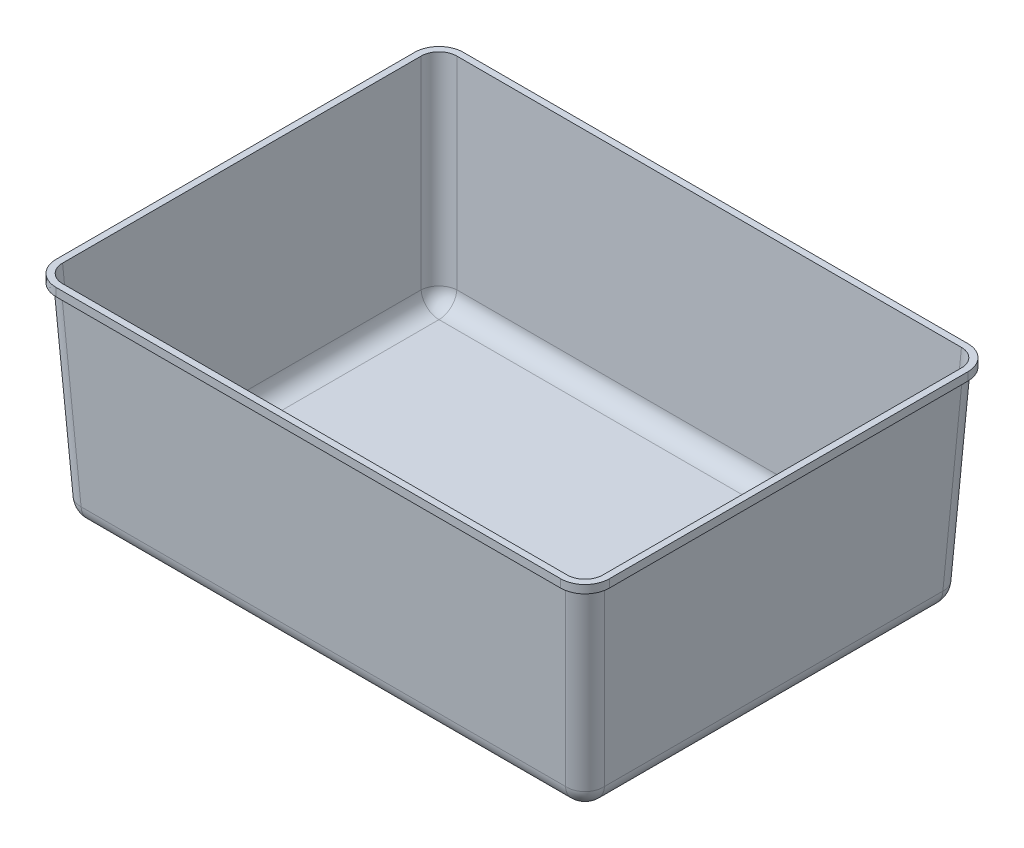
ISO-10303-21;
HEADER;
FILE_DESCRIPTION(('STEP AP214'),'2;1');
FILE_NAME('part.step','',(''),(''),'','','');
FILE_SCHEMA(('AUTOMOTIVE_DESIGN { 1 0 10303 214 1 1 1 1 }'));
ENDSEC;
DATA;
#1=APPLICATION_CONTEXT('core data for automotive mechanical design processes');
#2=APPLICATION_PROTOCOL_DEFINITION('international standard','automotive_design',2000,#1);
#3=PRODUCT_CONTEXT('',#1,'mechanical');
#4=PRODUCT('Part','Part','',(#3));
#5=PRODUCT_RELATED_PRODUCT_CATEGORY('part','',(#4));
#6=PRODUCT_DEFINITION_FORMATION('','',#4);
#7=PRODUCT_DEFINITION_CONTEXT('part definition',#1,'design');
#8=PRODUCT_DEFINITION('design','',#6,#7);
#9=PRODUCT_DEFINITION_SHAPE('','',#8);
#10=(LENGTH_UNIT() NAMED_UNIT(*) SI_UNIT(.MILLI.,.METRE.));
#11=(NAMED_UNIT(*) PLANE_ANGLE_UNIT() SI_UNIT($,.RADIAN.));
#12=(NAMED_UNIT(*) SI_UNIT($,.STERADIAN.) SOLID_ANGLE_UNIT());
#13=UNCERTAINTY_MEASURE_WITH_UNIT(LENGTH_MEASURE(1.E-05),#10,'distance_accuracy_value','');
#14=(GEOMETRIC_REPRESENTATION_CONTEXT(3) GLOBAL_UNCERTAINTY_ASSIGNED_CONTEXT((#13)) GLOBAL_UNIT_ASSIGNED_CONTEXT((#10,
#11,#12)) REPRESENTATION_CONTEXT('',''));
#15=CARTESIAN_POINT('',(0.,0.,0.));
#16=DIRECTION('',(0.,0.,1.));
#17=DIRECTION('',(1.,0.,0.));
#18=AXIS2_PLACEMENT_3D('',#15,#16,#17);
#19=CARTESIAN_POINT('',(0.,0.,-245.));
#20=DIRECTION('',(0.,-1.,0.));
#21=DIRECTION('',(0.,0.,-1.));
#22=AXIS2_PLACEMENT_3D('',#19,#20,#21);
#23=PLANE('',#22);
#24=DIRECTION('',(0.,0.,-1.));
#25=VECTOR('',#24,1.);
#26=CARTESIAN_POINT('',(333.998627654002,0.,0.));
#27=LINE('',#26,#25);
#28=CARTESIAN_POINT('',(333.998627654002,0.,-11.9862972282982));
#29=VERTEX_POINT('',#28);
#30=CARTESIAN_POINT('',(333.998627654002,0.,-233.013702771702));
#31=VERTEX_POINT('',#30);
#32=EDGE_CURVE('E641',#29,#31,#27,.T.);
#33=ORIENTED_EDGE('',*,*,#32,.F.);
#34=CARTESIAN_POINT('',(322.983531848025,0.,-12.0164681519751));
#35=DIRECTION('',(0.,-1.,0.));
#36=DIRECTION('',(0.707106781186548,0.,0.707106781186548));
#37=AXIS2_PLACEMENT_3D('',#34,#35,#36);
#38=ELLIPSE('',#37,11.0301709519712,11.);
#39=CARTESIAN_POINT('',(323.013702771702,0.,-1.00137234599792));
#40=VERTEX_POINT('',#39);
#41=EDGE_CURVE('E639',#40,#29,#38,.F.);
#42=ORIENTED_EDGE('',*,*,#41,.F.);
#43=DIRECTION('',(1.,0.,0.));
#44=VECTOR('',#43,1.);
#45=CARTESIAN_POINT('',(0.,0.,-1.00137234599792));
#46=LINE('',#45,#44);
#47=CARTESIAN_POINT('',(11.9862972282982,0.,-1.00137234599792));
#48=VERTEX_POINT('',#47);
#49=EDGE_CURVE('E636',#48,#40,#46,.T.);
#50=ORIENTED_EDGE('',*,*,#49,.F.);
#51=CARTESIAN_POINT('',(12.0164681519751,0.,-12.0164681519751));
#52=DIRECTION('',(0.,-1.,0.));
#53=DIRECTION('',(-0.707106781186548,0.,0.707106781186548));
#54=AXIS2_PLACEMENT_3D('',#51,#52,#53);
#55=ELLIPSE('',#54,11.0301709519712,11.);
#56=CARTESIAN_POINT('',(1.00137234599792,0.,-11.9862972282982));
#57=VERTEX_POINT('',#56);
#58=EDGE_CURVE('E637',#57,#48,#55,.F.);
#59=ORIENTED_EDGE('',*,*,#58,.F.);
#60=DIRECTION('',(0.,0.,1.));
#61=VECTOR('',#60,1.);
#62=CARTESIAN_POINT('',(1.00137234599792,0.,0.));
#63=LINE('',#62,#61);
#64=CARTESIAN_POINT('',(1.00137234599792,0.,-233.013702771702));
#65=VERTEX_POINT('',#64);
#66=EDGE_CURVE('E594',#65,#57,#63,.T.);
#67=ORIENTED_EDGE('',*,*,#66,.F.);
#68=CARTESIAN_POINT('',(12.0164681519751,0.,-232.983531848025));
#69=DIRECTION('',(0.,-1.,0.));
#70=DIRECTION('',(-0.707106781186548,0.,-0.707106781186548));
#71=AXIS2_PLACEMENT_3D('',#68,#69,#70);
#72=ELLIPSE('',#71,11.0301709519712,11.);
#73=CARTESIAN_POINT('',(11.9862972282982,0.,-243.998627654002));
#74=VERTEX_POINT('',#73);
#75=EDGE_CURVE('E489',#74,#65,#72,.F.);
#76=ORIENTED_EDGE('',*,*,#75,.F.);
#77=DIRECTION('',(-1.,0.,0.));
#78=VECTOR('',#77,1.);
#79=CARTESIAN_POINT('',(0.,0.,-243.998627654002));
#80=LINE('',#79,#78);
#81=CARTESIAN_POINT('',(323.013702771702,0.,-243.998627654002));
#82=VERTEX_POINT('',#81);
#83=EDGE_CURVE('E621',#82,#74,#80,.T.);
#84=ORIENTED_EDGE('',*,*,#83,.F.);
#85=CARTESIAN_POINT('',(322.983531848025,0.,-232.983531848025));
#86=DIRECTION('',(0.,-1.,0.));
#87=DIRECTION('',(0.707106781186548,0.,-0.707106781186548));
#88=AXIS2_PLACEMENT_3D('',#85,#86,#87);
#89=ELLIPSE('',#88,11.0301709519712,11.);
#90=EDGE_CURVE('E578',#31,#82,#89,.F.);
#91=ORIENTED_EDGE('',*,*,#90,.F.);
#92=EDGE_LOOP('',(#33,#42,#50,#59,#67,#76,#84,#91));
#93=FACE_BOUND('',#92,.T.);
#94=CARTESIAN_POINT('',(338.,0.,-11.9835544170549));
#95=CARTESIAN_POINT('',(338.,0.,-10.9943958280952));
#96=CARTESIAN_POINT('',(337.903206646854,0.,-10.0176261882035));
#97=CARTESIAN_POINT('',(337.615119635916,0.,-8.57076165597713));
#98=CARTESIAN_POINT('',(337.494318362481,0.,-8.08937501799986));
#99=CARTESIAN_POINT('',(337.208283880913,0.,-7.14870270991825));
#100=CARTESIAN_POINT('',(337.043088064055,0.,-6.68835549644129));
#101=CARTESIAN_POINT('',(336.482464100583,0.,-5.33660545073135));
#102=CARTESIAN_POINT('',(336.022635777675,0.,-4.47420761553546));
#103=CARTESIAN_POINT('',(334.9236283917,0.,-2.83018917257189));
#104=CARTESIAN_POINT('',(334.301766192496,0.,-2.07476078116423));
#105=CARTESIAN_POINT('',(333.267024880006,0.,-1.04030655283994));
#106=CARTESIAN_POINT('',(332.904878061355,0.,-0.711885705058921));
#107=CARTESIAN_POINT('',(332.145360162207,0.,-0.0885598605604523));
#108=CARTESIAN_POINT('',(331.746386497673,0.,0.207136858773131));
#109=CARTESIAN_POINT('',(330.521556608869,0.,1.02454261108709));
#110=CARTESIAN_POINT('',(329.661187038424,0.,1.48374052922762));
#111=CARTESIAN_POINT('',(328.305655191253,0.,2.04539020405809));
#112=CARTESIAN_POINT('',(327.84169649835,0.,2.21162740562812));
#113=CARTESIAN_POINT('',(326.896355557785,0.,2.49822231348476));
#114=CARTESIAN_POINT('',(326.419967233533,0.,2.61720086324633));
#115=CARTESIAN_POINT('',(324.979959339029,0.,2.90321173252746));
#116=CARTESIAN_POINT('',(324.005600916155,0.,3.));
#117=CARTESIAN_POINT('',(323.016445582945,0.,3.));
#118=B_SPLINE_CURVE_WITH_KNOTS('',3,(#94,#95,#96,#97,#98,#99,#100,#101,#102,#103,#104,#105,#106,
#107,#108,#109,#110,#111,#112,#113,#114,#115,#116,#117),.UNSPECIFIED.,.F.,.F.,(4,2,2,2,2,2,2,2,
2,2,2,4),(0.,0.125,0.187499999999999,0.249999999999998,0.374999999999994,0.49999999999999,
0.56249999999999,0.624999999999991,0.749999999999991,0.812499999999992,0.874999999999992,1.),.UNSPECIFIED.);
#119=CARTESIAN_POINT('',(323.016445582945,0.,3.));
#120=VERTEX_POINT('',#119);
#121=CARTESIAN_POINT('',(338.,0.,-11.9835544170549));
#122=VERTEX_POINT('',#121);
#123=EDGE_CURVE('E221',#120,#122,#118,.F.);
#124=ORIENTED_EDGE('',*,*,#123,.T.);
#125=DIRECTION('',(0.,0.,-1.));
#126=VECTOR('',#125,1.);
#127=CARTESIAN_POINT('',(338.,0.,-11.9835544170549));
#128=LINE('',#127,#126);
#129=CARTESIAN_POINT('',(338.,0.,-233.016445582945));
#130=VERTEX_POINT('',#129);
#131=EDGE_CURVE('E234',#122,#130,#128,.T.);
#132=ORIENTED_EDGE('',*,*,#131,.T.);
#133=CARTESIAN_POINT('',(323.016445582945,0.,-248.));
#134=CARTESIAN_POINT('',(324.005604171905,0.,-248.));
#135=CARTESIAN_POINT('',(324.982373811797,0.,-247.903206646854));
#136=CARTESIAN_POINT('',(326.429238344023,0.,-247.615119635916));
#137=CARTESIAN_POINT('',(326.910624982,0.,-247.494318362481));
#138=CARTESIAN_POINT('',(327.851297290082,0.,-247.208283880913));
#139=CARTESIAN_POINT('',(328.311644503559,0.,-247.043088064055));
#140=CARTESIAN_POINT('',(329.663394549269,0.,-246.482464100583));
#141=CARTESIAN_POINT('',(330.525792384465,0.,-246.022635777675));
#142=CARTESIAN_POINT('',(332.169810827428,0.,-244.9236283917));
#143=CARTESIAN_POINT('',(332.925239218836,0.,-244.301766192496));
#144=CARTESIAN_POINT('',(333.95969344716,0.,-243.267024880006));
#145=CARTESIAN_POINT('',(334.288114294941,0.,-242.904878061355));
#146=CARTESIAN_POINT('',(334.911440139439,0.,-242.145360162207));
#147=CARTESIAN_POINT('',(335.207136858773,0.,-241.746386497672));
#148=CARTESIAN_POINT('',(336.024542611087,0.,-240.521556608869));
#149=CARTESIAN_POINT('',(336.483740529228,0.,-239.661187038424));
#150=CARTESIAN_POINT('',(337.045390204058,0.,-238.305655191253));
#151=CARTESIAN_POINT('',(337.211627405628,0.,-237.841696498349));
#152=CARTESIAN_POINT('',(337.498222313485,0.,-236.896355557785));
#153=CARTESIAN_POINT('',(337.617200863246,0.,-236.419967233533));
#154=CARTESIAN_POINT('',(337.903211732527,0.,-234.979959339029));
#155=CARTESIAN_POINT('',(338.,0.,-234.005600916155));
#156=CARTESIAN_POINT('',(338.,0.,-233.016445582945));
#157=B_SPLINE_CURVE_WITH_KNOTS('',3,(#133,#134,#135,#136,#137,#138,#139,#140,#141,#142,#143,
#144,#145,#146,#147,#148,#149,#150,#151,#152,#153,#154,#155,#156),.UNSPECIFIED.,.F.,.F.,(4,2,2,
2,2,2,2,2,2,2,2,4),(0.,0.124999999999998,0.1875,0.250000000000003,0.375000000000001,
0.499999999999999,0.562499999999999,0.624999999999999,0.749999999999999,0.812499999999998,
0.874999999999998,1.),.UNSPECIFIED.);
#158=CARTESIAN_POINT('',(323.016445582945,0.,-248.));
#159=VERTEX_POINT('',#158);
#160=EDGE_CURVE('E239',#130,#159,#157,.F.);
#161=ORIENTED_EDGE('',*,*,#160,.T.);
#162=DIRECTION('',(-1.,0.,0.));
#163=VECTOR('',#162,1.);
#164=CARTESIAN_POINT('',(323.016445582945,0.,-248.));
#165=LINE('',#164,#163);
#166=CARTESIAN_POINT('',(11.9835544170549,0.,-248.));
#167=VERTEX_POINT('',#166);
#168=EDGE_CURVE('E368',#159,#167,#165,.T.);
#169=ORIENTED_EDGE('',*,*,#168,.T.);
#170=CARTESIAN_POINT('',(-3.,0.,-233.016445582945));
#171=CARTESIAN_POINT('',(-3.,0.,-234.005604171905));
#172=CARTESIAN_POINT('',(-2.90320664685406,0.,-234.982373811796));
#173=CARTESIAN_POINT('',(-2.61511963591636,0.,-236.429238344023));
#174=CARTESIAN_POINT('',(-2.49431836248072,0.,-236.910624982));
#175=CARTESIAN_POINT('',(-2.20828388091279,0.,-237.851297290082));
#176=CARTESIAN_POINT('',(-2.04308806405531,0.,-238.311644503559));
#177=CARTESIAN_POINT('',(-1.4824641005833,0.,-239.663394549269));
#178=CARTESIAN_POINT('',(-1.02263577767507,0.,-240.525792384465));
#179=CARTESIAN_POINT('',(0.0763716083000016,0.,-242.169810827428));
#180=CARTESIAN_POINT('',(0.698233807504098,0.,-242.925239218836));
#181=CARTESIAN_POINT('',(1.73297511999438,0.,-243.95969344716));
#182=CARTESIAN_POINT('',(2.0951219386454,0.,-244.288114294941));
#183=CARTESIAN_POINT('',(2.85463983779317,0.,-244.91144013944));
#184=CARTESIAN_POINT('',(3.25361350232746,0.,-245.207136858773));
#185=CARTESIAN_POINT('',(4.47844339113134,0.,-246.024542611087));
#186=CARTESIAN_POINT('',(5.33881296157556,0.,-246.483740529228));
#187=CARTESIAN_POINT('',(6.69434480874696,0.,-247.045390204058));
#188=CARTESIAN_POINT('',(7.15830350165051,0.,-247.211627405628));
#189=CARTESIAN_POINT('',(8.10364444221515,0.,-247.498222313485));
#190=CARTESIAN_POINT('',(8.58003276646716,0.,-247.617200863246));
#191=CARTESIAN_POINT('',(10.0200406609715,0.,-247.903211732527));
#192=CARTESIAN_POINT('',(10.9943990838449,0.,-248.));
#193=CARTESIAN_POINT('',(11.9835544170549,0.,-248.));
#194=B_SPLINE_CURVE_WITH_KNOTS('',3,(#170,#171,#172,#173,#174,#175,#176,#177,#178,#179,#180,
#181,#182,#183,#184,#185,#186,#187,#188,#189,#190,#191,#192,#193),.UNSPECIFIED.,.F.,.F.,(4,2,2,
2,2,2,2,2,2,2,2,4),(0.,0.124999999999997,0.187499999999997,0.249999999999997,0.374999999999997,
0.499999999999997,0.562499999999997,0.624999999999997,0.749999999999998,0.812499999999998,
0.874999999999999,1.),.UNSPECIFIED.);
#195=CARTESIAN_POINT('',(-3.,0.,-233.016445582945));
#196=VERTEX_POINT('',#195);
#197=EDGE_CURVE('E367',#167,#196,#194,.F.);
#198=ORIENTED_EDGE('',*,*,#197,.T.);
#199=DIRECTION('',(0.,0.,1.));
#200=VECTOR('',#199,1.);
#201=CARTESIAN_POINT('',(-3.,0.,-233.016445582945));
#202=LINE('',#201,#200);
#203=CARTESIAN_POINT('',(-3.,0.,-11.9835544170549));
#204=VERTEX_POINT('',#203);
#205=EDGE_CURVE('E286',#196,#204,#202,.T.);
#206=ORIENTED_EDGE('',*,*,#205,.T.);
#207=CARTESIAN_POINT('',(11.9835544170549,0.,3.));
#208=CARTESIAN_POINT('',(10.9943958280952,0.,3.));
#209=CARTESIAN_POINT('',(10.0176261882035,0.,2.90320664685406));
#210=CARTESIAN_POINT('',(8.57076165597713,0.,2.61511963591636));
#211=CARTESIAN_POINT('',(8.08937501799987,0.,2.49431836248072));
#212=CARTESIAN_POINT('',(7.14870270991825,0.,2.20828388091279));
#213=CARTESIAN_POINT('',(6.68835549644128,0.,2.04308806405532));
#214=CARTESIAN_POINT('',(5.33660545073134,0.,1.48246410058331));
#215=CARTESIAN_POINT('',(4.47420761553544,0.,1.02263577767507));
#216=CARTESIAN_POINT('',(2.83018917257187,0.,-0.0763716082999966));
#217=CARTESIAN_POINT('',(2.07476078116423,0.,-0.698233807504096));
#218=CARTESIAN_POINT('',(1.04030655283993,0.,-1.73297511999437));
#219=CARTESIAN_POINT('',(0.711885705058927,0.,-2.0951219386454));
#220=CARTESIAN_POINT('',(0.0885598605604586,0.,-2.85463983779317));
#221=CARTESIAN_POINT('',(-0.207136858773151,0.,-3.25361350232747));
#222=CARTESIAN_POINT('',(-1.0245426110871,0.,-4.47844339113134));
#223=CARTESIAN_POINT('',(-1.48374052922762,0.,-5.33881296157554));
#224=CARTESIAN_POINT('',(-2.0453902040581,0.,-6.69434480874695));
#225=CARTESIAN_POINT('',(-2.21162740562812,0.,-7.1583035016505));
#226=CARTESIAN_POINT('',(-2.49822231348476,0.,-8.10364444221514));
#227=CARTESIAN_POINT('',(-2.61720086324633,0.,-8.58003276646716));
#228=CARTESIAN_POINT('',(-2.90321173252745,0.,-10.0200406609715));
#229=CARTESIAN_POINT('',(-3.,0.,-10.9943990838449));
#230=CARTESIAN_POINT('',(-3.,0.,-11.9835544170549));
#231=B_SPLINE_CURVE_WITH_KNOTS('',3,(#207,#208,#209,#210,#211,#212,#213,#214,#215,#216,#217,
#218,#219,#220,#221,#222,#223,#224,#225,#226,#227,#228,#229,#230),.UNSPECIFIED.,.F.,.F.,(4,2,2,
2,2,2,2,2,2,2,2,4),(0.,0.125,0.1875,0.25,0.375,0.5,0.5625,0.625,0.75,0.8125,0.875,1.),.UNSPECIFIED.);
#232=CARTESIAN_POINT('',(11.9835544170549,0.,3.));
#233=VERTEX_POINT('',#232);
#234=EDGE_CURVE('E284',#204,#233,#231,.F.);
#235=ORIENTED_EDGE('',*,*,#234,.T.);
#236=DIRECTION('',(1.,0.,0.));
#237=VECTOR('',#236,1.);
#238=CARTESIAN_POINT('',(11.9835544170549,0.,3.));
#239=LINE('',#238,#237);
#240=EDGE_CURVE('E244',#233,#120,#239,.T.);
#241=ORIENTED_EDGE('',*,*,#240,.T.);
#242=EDGE_LOOP('',(#124,#132,#161,#169,#198,#206,#235,#241));
#243=FACE_BOUND('',#242,.T.);
#244=ADVANCED_FACE('F26',(#93,#243),#23,.F.);
#245=CARTESIAN_POINT('',(0.998629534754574,0.0523359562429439,0.));
#246=DIRECTION('',(-0.998629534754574,-0.0523359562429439,0.));
#247=DIRECTION('',(0.052335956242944,-0.998629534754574,0.));
#248=AXIS2_PLACEMENT_3D('',#245,#246,#247);
#249=PLANE('',#248);
#250=DIRECTION('',(0.,0.,1.));
#251=VECTOR('',#250,1.);
#252=CARTESIAN_POINT('',(7.21566122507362,-118.575695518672,0.));
#253=LINE('',#252,#251);
#254=CARTESIAN_POINT('',(7.21566122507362,-118.575695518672,-226.799413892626));
#255=VERTEX_POINT('',#254);
#256=CARTESIAN_POINT('',(7.21566122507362,-118.575695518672,-18.2005861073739));
#257=VERTEX_POINT('',#256);
#258=EDGE_CURVE('E486',#255,#257,#253,.T.);
#259=ORIENTED_EDGE('',*,*,#258,.F.);
#260=DIRECTION('',(-0.052264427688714,0.997264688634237,-0.052264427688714));
#261=VECTOR('',#260,1.);
#262=CARTESIAN_POINT('',(0.965895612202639,0.676936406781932,-233.049179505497));
#263=LINE('',#262,#261);
#264=EDGE_CURVE('E566',#65,#255,#263,.F.);
#265=ORIENTED_EDGE('',*,*,#264,.F.);
#266=ORIENTED_EDGE('',*,*,#66,.T.);
#267=DIRECTION('',(-0.052264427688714,0.997264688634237,0.052264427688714));
#268=VECTOR('',#267,1.);
#269=CARTESIAN_POINT('',(0.965895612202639,0.676936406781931,-11.9508204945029));
#270=LINE('',#269,#268);
#271=EDGE_CURVE('E483',#257,#57,#270,.T.);
#272=ORIENTED_EDGE('',*,*,#271,.F.);
#273=EDGE_LOOP('',(#259,#265,#266,#272));
#274=FACE_BOUND('',#273,.T.);
#275=ADVANCED_FACE('F261',(#274),#249,.F.);
#276=CARTESIAN_POINT('',(0.,0.0523359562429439,-244.001370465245));
#277=DIRECTION('',(0.,-0.0523359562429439,-0.998629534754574));
#278=DIRECTION('',(0.,0.998629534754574,-0.052335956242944));
#279=AXIS2_PLACEMENT_3D('',#276,#277,#278);
#280=PLANE('',#279);
#281=ORIENTED_EDGE('',*,*,#83,.T.);
#282=DIRECTION('',(-0.052264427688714,0.997264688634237,-0.052264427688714));
#283=VECTOR('',#282,1.);
#284=CARTESIAN_POINT('',(11.950820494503,0.676936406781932,-244.034104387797));
#285=LINE('',#284,#283);
#286=CARTESIAN_POINT('',(18.2005861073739,-118.575695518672,-237.784338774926));
#287=VERTEX_POINT('',#286);
#288=EDGE_CURVE('E618',#287,#74,#285,.T.);
#289=ORIENTED_EDGE('',*,*,#288,.F.);
#290=DIRECTION('',(1.,0.,0.));
#291=VECTOR('',#290,1.);
#292=CARTESIAN_POINT('',(0.,-118.575695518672,-237.784338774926));
#293=LINE('',#292,#291);
#294=CARTESIAN_POINT('',(316.799413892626,-118.575695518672,-237.784338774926));
#295=VERTEX_POINT('',#294);
#296=EDGE_CURVE('E620',#295,#287,#293,.F.);
#297=ORIENTED_EDGE('',*,*,#296,.F.);
#298=DIRECTION('',(0.052264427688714,0.997264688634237,-0.052264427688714));
#299=VECTOR('',#298,1.);
#300=CARTESIAN_POINT('',(322.379944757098,-12.0928233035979,-243.364869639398));
#301=LINE('',#300,#299);
#302=EDGE_CURVE('E602',#82,#295,#301,.F.);
#303=ORIENTED_EDGE('',*,*,#302,.F.);
#304=EDGE_LOOP('',(#281,#289,#297,#303));
#305=FACE_BOUND('',#304,.T.);
#306=ADVANCED_FACE('F651',(#305),#280,.F.);
#307=CARTESIAN_POINT('',(334.001370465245,0.0523359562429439,0.));
#308=DIRECTION('',(0.998629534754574,-0.0523359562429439,0.));
#309=DIRECTION('',(0.052335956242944,0.998629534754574,0.));
#310=AXIS2_PLACEMENT_3D('',#307,#308,#309);
#311=PLANE('',#310);
#312=DIRECTION('',(0.,0.,1.));
#313=VECTOR('',#312,1.);
#314=CARTESIAN_POINT('',(327.784338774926,-118.575695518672,0.));
#315=LINE('',#314,#313);
#316=CARTESIAN_POINT('',(327.784338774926,-118.575695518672,-18.2005861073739));
#317=VERTEX_POINT('',#316);
#318=CARTESIAN_POINT('',(327.784338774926,-118.575695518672,-226.799413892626));
#319=VERTEX_POINT('',#318);
#320=EDGE_CURVE('E587',#317,#319,#315,.F.);
#321=ORIENTED_EDGE('',*,*,#320,.F.);
#322=DIRECTION('',(0.052264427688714,0.997264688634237,0.052264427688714));
#323=VECTOR('',#322,1.);
#324=CARTESIAN_POINT('',(333.119028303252,-16.7837554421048,-12.8658965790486));
#325=LINE('',#324,#323);
#326=EDGE_CURVE('E585',#29,#317,#325,.F.);
#327=ORIENTED_EDGE('',*,*,#326,.F.);
#328=ORIENTED_EDGE('',*,*,#32,.T.);
#329=DIRECTION('',(0.052264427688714,0.997264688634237,-0.052264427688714));
#330=VECTOR('',#329,1.);
#331=CARTESIAN_POINT('',(333.364869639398,-12.0928233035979,-232.379944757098));
#332=LINE('',#331,#330);
#333=EDGE_CURVE('E590',#319,#31,#332,.T.);
#334=ORIENTED_EDGE('',*,*,#333,.F.);
#335=EDGE_LOOP('',(#321,#327,#328,#334));
#336=FACE_BOUND('',#335,.T.);
#337=ADVANCED_FACE('F690',(#336),#311,.F.);
#338=CARTESIAN_POINT('',(0.,0.0523359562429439,-0.998629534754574));
#339=DIRECTION('',(0.,-0.0523359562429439,0.998629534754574));
#340=DIRECTION('',(0.,-0.998629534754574,-0.052335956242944));
#341=AXIS2_PLACEMENT_3D('',#338,#339,#340);
#342=PLANE('',#341);
#343=DIRECTION('',(1.,0.,0.));
#344=VECTOR('',#343,1.);
#345=CARTESIAN_POINT('',(0.,-118.575695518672,-7.21566122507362));
#346=LINE('',#345,#344);
#347=CARTESIAN_POINT('',(18.2005861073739,-118.575695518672,-7.21566122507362));
#348=VERTEX_POINT('',#347);
#349=CARTESIAN_POINT('',(316.799413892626,-118.575695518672,-7.21566122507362));
#350=VERTEX_POINT('',#349);
#351=EDGE_CURVE('E577',#348,#350,#346,.T.);
#352=ORIENTED_EDGE('',*,*,#351,.F.);
#353=DIRECTION('',(-0.052264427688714,0.997264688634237,0.052264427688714));
#354=VECTOR('',#353,1.);
#355=CARTESIAN_POINT('',(11.9508204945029,0.676936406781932,-0.965895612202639));
#356=LINE('',#355,#354);
#357=EDGE_CURVE('E575',#48,#348,#356,.F.);
#358=ORIENTED_EDGE('',*,*,#357,.F.);
#359=ORIENTED_EDGE('',*,*,#49,.T.);
#360=DIRECTION('',(0.0522644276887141,0.997264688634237,0.052264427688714));
#361=VECTOR('',#360,1.);
#362=CARTESIAN_POINT('',(322.134103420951,-16.7837554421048,-1.88097169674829));
#363=LINE('',#362,#361);
#364=EDGE_CURVE('E569',#350,#40,#363,.T.);
#365=ORIENTED_EDGE('',*,*,#364,.F.);
#366=EDGE_LOOP('',(#352,#358,#359,#365));
#367=FACE_BOUND('',#366,.T.);
#368=ADVANCED_FACE('F702',(#367),#342,.F.);
#369=CARTESIAN_POINT('',(0.,-129.,-245.));
#370=DIRECTION('',(0.,-1.,0.));
#371=DIRECTION('',(0.,0.,-1.));
#372=AXIS2_PLACEMENT_3D('',#369,#370,#371);
#373=PLANE('',#372);
#374=CARTESIAN_POINT('',(266.799413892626,-129.,-176.799413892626));
#375=DIRECTION('',(0.,-1.,0.));
#376=DIRECTION('',(0.,0.,-1.));
#377=AXIS2_PLACEMENT_3D('',#374,#375,#376);
#378=CIRCLE('',#377,13.5);
#379=CARTESIAN_POINT('',(266.799413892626,-129.,-190.299413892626));
#380=VERTEX_POINT('',#379);
#381=EDGE_CURVE('E245',#380,#380,#378,.T.);
#382=ORIENTED_EDGE('',*,*,#381,.T.);
#383=EDGE_LOOP('',(#382));
#384=FACE_BOUND('',#383,.T.);
#385=DIRECTION('',(0.,0.,-1.));
#386=VECTOR('',#385,1.);
#387=CARTESIAN_POINT('',(18.2005861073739,-129.,-245.));
#388=LINE('',#387,#386);
#389=CARTESIAN_POINT('',(18.2005861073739,-129.,-18.2005861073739));
#390=VERTEX_POINT('',#389);
#391=CARTESIAN_POINT('',(18.2005861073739,-129.,-226.799413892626));
#392=VERTEX_POINT('',#391);
#393=EDGE_CURVE('E599',#390,#392,#388,.T.);
#394=ORIENTED_EDGE('',*,*,#393,.F.);
#395=DIRECTION('',(1.,0.,0.));
#396=VECTOR('',#395,1.);
#397=CARTESIAN_POINT('',(0.,-129.,-18.2005861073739));
#398=LINE('',#397,#396);
#399=CARTESIAN_POINT('',(316.799413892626,-129.,-18.2005861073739));
#400=VERTEX_POINT('',#399);
#401=EDGE_CURVE('E601',#400,#390,#398,.F.);
#402=ORIENTED_EDGE('',*,*,#401,.F.);
#403=DIRECTION('',(0.,0.,-1.));
#404=VECTOR('',#403,1.);
#405=CARTESIAN_POINT('',(316.799413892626,-129.,-245.));
#406=LINE('',#405,#404);
#407=CARTESIAN_POINT('',(316.799413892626,-129.,-226.799413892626));
#408=VERTEX_POINT('',#407);
#409=EDGE_CURVE('E605',#408,#400,#406,.F.);
#410=ORIENTED_EDGE('',*,*,#409,.F.);
#411=DIRECTION('',(1.,0.,0.));
#412=VECTOR('',#411,1.);
#413=CARTESIAN_POINT('',(0.,-129.,-226.799413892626));
#414=LINE('',#413,#412);
#415=EDGE_CURVE('E588',#392,#408,#414,.T.);
#416=ORIENTED_EDGE('',*,*,#415,.F.);
#417=EDGE_LOOP('',(#394,#402,#410,#416));
#418=FACE_BOUND('',#417,.T.);
#419=ADVANCED_FACE('F675',(#384,#418),#373,.F.);
#420=CARTESIAN_POINT('',(322.134103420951,-16.2080599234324,-12.8658965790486));
#421=DIRECTION('',(0.052264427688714,0.997264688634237,0.052264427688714));
#422=DIRECTION('',(0.,-0.0523359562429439,0.998629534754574));
#423=AXIS2_PLACEMENT_3D('',#420,#421,#422);
#424=CYLINDRICAL_SURFACE('',#423,11.);
#425=ORIENTED_EDGE('',*,*,#41,.T.);
#426=ORIENTED_EDGE('',*,*,#326,.T.);
#427=CARTESIAN_POINT('',(316.799413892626,-118.,-18.2005861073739));
#428=DIRECTION('',(0.052264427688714,0.997264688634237,0.052264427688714));
#429=DIRECTION('',(0.,-0.0523359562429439,0.998629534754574));
#430=AXIS2_PLACEMENT_3D('',#427,#428,#429);
#431=CIRCLE('',#430,11.);
#432=EDGE_CURVE('E573',#317,#350,#431,.F.);
#433=ORIENTED_EDGE('',*,*,#432,.T.);
#434=ORIENTED_EDGE('',*,*,#364,.T.);
#435=EDGE_LOOP('',(#425,#426,#433,#434));
#436=FACE_BOUND('',#435,.T.);
#437=ADVANCED_FACE('F696',(#436),#424,.F.);
#438=CARTESIAN_POINT('',(11.9508204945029,1.25263192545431,-11.9508204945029));
#439=DIRECTION('',(-0.052264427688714,0.997264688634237,0.052264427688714));
#440=DIRECTION('',(0.,-0.0523359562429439,0.998629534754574));
#441=AXIS2_PLACEMENT_3D('',#438,#439,#440);
#442=CYLINDRICAL_SURFACE('',#441,11.);
#443=ORIENTED_EDGE('',*,*,#58,.T.);
#444=ORIENTED_EDGE('',*,*,#357,.T.);
#445=CARTESIAN_POINT('',(18.2005861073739,-118.,-18.2005861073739));
#446=DIRECTION('',(-0.052264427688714,0.997264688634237,0.052264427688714));
#447=DIRECTION('',(0.,-0.0523359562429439,0.998629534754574));
#448=AXIS2_PLACEMENT_3D('',#445,#446,#447);
#449=CIRCLE('',#448,11.);
#450=EDGE_CURVE('E570',#348,#257,#449,.F.);
#451=ORIENTED_EDGE('',*,*,#450,.T.);
#452=ORIENTED_EDGE('',*,*,#271,.T.);
#453=EDGE_LOOP('',(#443,#444,#451,#452));
#454=FACE_BOUND('',#453,.T.);
#455=ADVANCED_FACE('F713',(#454),#442,.F.);
#456=CARTESIAN_POINT('',(0.,-118.,-18.2005861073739));
#457=DIRECTION('',(1.,0.,0.));
#458=DIRECTION('',(0.,0.,-1.));
#459=AXIS2_PLACEMENT_3D('',#456,#457,#458);
#460=CYLINDRICAL_SURFACE('',#459,11.);
#461=CARTESIAN_POINT('',(316.799413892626,-118.,-18.2005861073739));
#462=DIRECTION('',(-1.,0.,0.));
#463=DIRECTION('',(0.,-1.,0.));
#464=AXIS2_PLACEMENT_3D('',#461,#462,#463);
#465=CIRCLE('',#464,11.);
#466=EDGE_CURVE('E584',#350,#400,#465,.F.);
#467=ORIENTED_EDGE('',*,*,#466,.T.);
#468=ORIENTED_EDGE('',*,*,#401,.T.);
#469=CARTESIAN_POINT('',(18.2005861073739,-118.,-18.2005861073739));
#470=DIRECTION('',(-1.,0.,0.));
#471=DIRECTION('',(0.,-1.,0.));
#472=AXIS2_PLACEMENT_3D('',#469,#470,#471);
#473=CIRCLE('',#472,11.);
#474=EDGE_CURVE('E574',#390,#348,#473,.T.);
#475=ORIENTED_EDGE('',*,*,#474,.T.);
#476=ORIENTED_EDGE('',*,*,#351,.T.);
#477=EDGE_LOOP('',(#467,#468,#475,#476));
#478=FACE_BOUND('',#477,.T.);
#479=ADVANCED_FACE('F708',(#478),#460,.F.);
#480=CARTESIAN_POINT('',(316.799413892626,-118.,-18.2005861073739));
#481=DIRECTION('',(0.,0.,1.));
#482=DIRECTION('',(1.,0.,0.));
#483=AXIS2_PLACEMENT_3D('',#480,#481,#482);
#484=SPHERICAL_SURFACE('',#483,11.);
#485=ORIENTED_EDGE('',*,*,#432,.F.);
#486=CARTESIAN_POINT('',(316.799413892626,-118.,-18.2005861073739));
#487=DIRECTION('',(0.,0.,-1.));
#488=DIRECTION('',(-1.,0.,0.));
#489=AXIS2_PLACEMENT_3D('',#486,#487,#488);
#490=CIRCLE('',#489,11.);
#491=EDGE_CURVE('E595',#317,#400,#490,.T.);
#492=ORIENTED_EDGE('',*,*,#491,.T.);
#493=ORIENTED_EDGE('',*,*,#466,.F.);
#494=EDGE_LOOP('',(#485,#492,#493));
#495=FACE_BOUND('',#494,.T.);
#496=ADVANCED_FACE('F706',(#495),#484,.F.);
#497=CARTESIAN_POINT('',(18.2005861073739,-118.,-18.2005861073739));
#498=DIRECTION('',(0.,0.,1.));
#499=DIRECTION('',(1.,0.,0.));
#500=AXIS2_PLACEMENT_3D('',#497,#498,#499);
#501=SPHERICAL_SURFACE('',#500,11.);
#502=ORIENTED_EDGE('',*,*,#474,.F.);
#503=CARTESIAN_POINT('',(18.2005861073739,-118.,-18.2005861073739));
#504=DIRECTION('',(0.,0.,1.));
#505=DIRECTION('',(1.,0.,0.));
#506=AXIS2_PLACEMENT_3D('',#503,#504,#505);
#507=CIRCLE('',#506,11.);
#508=EDGE_CURVE('E598',#390,#257,#507,.F.);
#509=ORIENTED_EDGE('',*,*,#508,.T.);
#510=ORIENTED_EDGE('',*,*,#450,.F.);
#511=EDGE_LOOP('',(#502,#509,#510));
#512=FACE_BOUND('',#511,.T.);
#513=ADVANCED_FACE('F711',(#512),#501,.F.);
#514=CARTESIAN_POINT('',(316.799413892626,-118.,0.));
#515=DIRECTION('',(0.,0.,-1.));
#516=DIRECTION('',(-1.,0.,0.));
#517=AXIS2_PLACEMENT_3D('',#514,#515,#516);
#518=CYLINDRICAL_SURFACE('',#517,11.);
#519=ORIENTED_EDGE('',*,*,#491,.F.);
#520=ORIENTED_EDGE('',*,*,#320,.T.);
#521=CARTESIAN_POINT('',(316.799413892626,-118.,-226.799413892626));
#522=DIRECTION('',(0.,0.,1.));
#523=DIRECTION('',(1.,0.,0.));
#524=AXIS2_PLACEMENT_3D('',#521,#522,#523);
#525=CIRCLE('',#524,11.);
#526=EDGE_CURVE('E612',#319,#408,#525,.F.);
#527=ORIENTED_EDGE('',*,*,#526,.T.);
#528=ORIENTED_EDGE('',*,*,#409,.T.);
#529=EDGE_LOOP('',(#519,#520,#527,#528));
#530=FACE_BOUND('',#529,.T.);
#531=ADVANCED_FACE('F685',(#530),#518,.F.);
#532=CARTESIAN_POINT('',(322.379944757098,-11.5171277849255,-232.379944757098));
#533=DIRECTION('',(0.052264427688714,0.997264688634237,-0.052264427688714));
#534=DIRECTION('',(0.,0.0523359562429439,0.998629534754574));
#535=AXIS2_PLACEMENT_3D('',#532,#533,#534);
#536=CYLINDRICAL_SURFACE('',#535,11.);
#537=ORIENTED_EDGE('',*,*,#90,.T.);
#538=ORIENTED_EDGE('',*,*,#302,.T.);
#539=CARTESIAN_POINT('',(316.799413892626,-118.,-226.799413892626));
#540=DIRECTION('',(0.052264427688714,0.997264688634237,-0.052264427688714));
#541=DIRECTION('',(0.,0.0523359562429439,0.998629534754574));
#542=AXIS2_PLACEMENT_3D('',#539,#540,#541);
#543=CIRCLE('',#542,11.);
#544=EDGE_CURVE('E624',#295,#319,#543,.F.);
#545=ORIENTED_EDGE('',*,*,#544,.T.);
#546=ORIENTED_EDGE('',*,*,#333,.T.);
#547=EDGE_LOOP('',(#537,#538,#545,#546));
#548=FACE_BOUND('',#547,.T.);
#549=ADVANCED_FACE('F692',(#548),#536,.F.);
#550=CARTESIAN_POINT('',(11.9508204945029,1.25263192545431,-233.049179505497));
#551=DIRECTION('',(-0.052264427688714,0.997264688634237,-0.052264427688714));
#552=DIRECTION('',(0.,0.0523359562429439,0.998629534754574));
#553=AXIS2_PLACEMENT_3D('',#550,#551,#552);
#554=CYLINDRICAL_SURFACE('',#553,11.);
#555=ORIENTED_EDGE('',*,*,#75,.T.);
#556=ORIENTED_EDGE('',*,*,#264,.T.);
#557=CARTESIAN_POINT('',(18.2005861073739,-118.,-226.799413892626));
#558=DIRECTION('',(-0.052264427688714,0.997264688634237,-0.052264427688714));
#559=DIRECTION('',(0.,0.0523359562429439,0.998629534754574));
#560=AXIS2_PLACEMENT_3D('',#557,#558,#559);
#561=CIRCLE('',#560,11.);
#562=EDGE_CURVE('E616',#255,#287,#561,.F.);
#563=ORIENTED_EDGE('',*,*,#562,.T.);
#564=ORIENTED_EDGE('',*,*,#288,.T.);
#565=EDGE_LOOP('',(#555,#556,#563,#564));
#566=FACE_BOUND('',#565,.T.);
#567=ADVANCED_FACE('F659',(#566),#554,.F.);
#568=CARTESIAN_POINT('',(18.2005861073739,-118.,0.));
#569=DIRECTION('',(0.,0.,1.));
#570=DIRECTION('',(1.,0.,0.));
#571=AXIS2_PLACEMENT_3D('',#568,#569,#570);
#572=CYLINDRICAL_SURFACE('',#571,11.);
#573=ORIENTED_EDGE('',*,*,#508,.F.);
#574=ORIENTED_EDGE('',*,*,#393,.T.);
#575=CARTESIAN_POINT('',(18.2005861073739,-118.,-226.799413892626));
#576=DIRECTION('',(0.,0.,1.));
#577=DIRECTION('',(1.,0.,0.));
#578=AXIS2_PLACEMENT_3D('',#575,#576,#577);
#579=CIRCLE('',#578,11.);
#580=EDGE_CURVE('E613',#392,#255,#579,.F.);
#581=ORIENTED_EDGE('',*,*,#580,.T.);
#582=ORIENTED_EDGE('',*,*,#258,.T.);
#583=EDGE_LOOP('',(#573,#574,#581,#582));
#584=FACE_BOUND('',#583,.T.);
#585=ADVANCED_FACE('F671',(#584),#572,.F.);
#586=CARTESIAN_POINT('',(316.799413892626,-118.,-226.799413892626));
#587=DIRECTION('',(0.,0.,1.));
#588=DIRECTION('',(1.,0.,0.));
#589=AXIS2_PLACEMENT_3D('',#586,#587,#588);
#590=SPHERICAL_SURFACE('',#589,11.);
#591=ORIENTED_EDGE('',*,*,#544,.F.);
#592=CARTESIAN_POINT('',(316.799413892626,-118.,-226.799413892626));
#593=DIRECTION('',(-1.,0.,0.));
#594=DIRECTION('',(0.,0.,1.));
#595=AXIS2_PLACEMENT_3D('',#592,#593,#594);
#596=CIRCLE('',#595,11.);
#597=EDGE_CURVE('E617',#295,#408,#596,.T.);
#598=ORIENTED_EDGE('',*,*,#597,.T.);
#599=ORIENTED_EDGE('',*,*,#526,.F.);
#600=EDGE_LOOP('',(#591,#598,#599));
#601=FACE_BOUND('',#600,.T.);
#602=ADVANCED_FACE('F682',(#601),#590,.F.);
#603=CARTESIAN_POINT('',(18.2005861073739,-118.,-226.799413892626));
#604=DIRECTION('',(0.,0.,1.));
#605=DIRECTION('',(1.,0.,0.));
#606=AXIS2_PLACEMENT_3D('',#603,#604,#605);
#607=SPHERICAL_SURFACE('',#606,11.);
#608=ORIENTED_EDGE('',*,*,#580,.F.);
#609=CARTESIAN_POINT('',(18.2005861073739,-118.,-226.799413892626));
#610=DIRECTION('',(-1.,0.,0.));
#611=DIRECTION('',(0.,0.,1.));
#612=AXIS2_PLACEMENT_3D('',#609,#610,#611);
#613=CIRCLE('',#612,11.);
#614=EDGE_CURVE('E565',#392,#287,#613,.F.);
#615=ORIENTED_EDGE('',*,*,#614,.T.);
#616=ORIENTED_EDGE('',*,*,#562,.F.);
#617=EDGE_LOOP('',(#608,#615,#616));
#618=FACE_BOUND('',#617,.T.);
#619=ADVANCED_FACE('F668',(#618),#607,.F.);
#620=CARTESIAN_POINT('',(0.,-118.,-226.799413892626));
#621=DIRECTION('',(-1.,0.,0.));
#622=DIRECTION('',(0.,0.,1.));
#623=AXIS2_PLACEMENT_3D('',#620,#621,#622);
#624=CYLINDRICAL_SURFACE('',#623,11.);
#625=ORIENTED_EDGE('',*,*,#597,.F.);
#626=ORIENTED_EDGE('',*,*,#296,.T.);
#627=ORIENTED_EDGE('',*,*,#614,.F.);
#628=ORIENTED_EDGE('',*,*,#415,.T.);
#629=EDGE_LOOP('',(#625,#626,#627,#628));
#630=FACE_BOUND('',#629,.T.);
#631=ADVANCED_FACE('F425',(#630),#624,.F.);
#632=CARTESIAN_POINT('',(323.016445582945,-5.,3.));
#633=CARTESIAN_POINT('',(324.005600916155,-5.,3.));
#634=CARTESIAN_POINT('',(324.979959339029,-5.,2.90321173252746));
#635=CARTESIAN_POINT('',(326.419967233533,-5.,2.61720086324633));
#636=CARTESIAN_POINT('',(326.896355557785,-5.,2.49822231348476));
#637=CARTESIAN_POINT('',(327.84169649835,-5.,2.21162740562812));
#638=CARTESIAN_POINT('',(328.305655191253,-5.,2.04539020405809));
#639=CARTESIAN_POINT('',(329.661187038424,-5.,1.48374052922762));
#640=CARTESIAN_POINT('',(330.521556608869,-5.,1.02454261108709));
#641=CARTESIAN_POINT('',(331.746386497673,-5.,0.207136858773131));
#642=CARTESIAN_POINT('',(332.145360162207,-5.,-0.0885598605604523));
#643=CARTESIAN_POINT('',(332.904878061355,-5.,-0.711885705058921));
#644=CARTESIAN_POINT('',(333.267024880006,-5.,-1.04030655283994));
#645=CARTESIAN_POINT('',(334.301766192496,-5.,-2.07476078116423));
#646=CARTESIAN_POINT('',(334.9236283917,-5.,-2.83018917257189));
#647=CARTESIAN_POINT('',(336.022635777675,-5.,-4.47420761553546));
#648=CARTESIAN_POINT('',(336.482464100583,-5.,-5.33660545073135));
#649=CARTESIAN_POINT('',(337.043088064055,-5.,-6.68835549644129));
#650=CARTESIAN_POINT('',(337.208283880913,-5.,-7.14870270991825));
#651=CARTESIAN_POINT('',(337.494318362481,-5.,-8.08937501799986));
#652=CARTESIAN_POINT('',(337.615119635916,-5.,-8.57076165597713));
#653=CARTESIAN_POINT('',(337.903206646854,-5.,-10.0176261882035));
#654=CARTESIAN_POINT('',(338.,-5.,-10.9943958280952));
#655=CARTESIAN_POINT('',(338.,-5.,-11.9835544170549));
#656=B_SPLINE_CURVE_WITH_KNOTS('',3,(#632,#633,#634,#635,#636,#637,#638,#639,#640,#641,#642,
#643,#644,#645,#646,#647,#648,#649,#650,#651,#652,#653,#654,#655),.UNSPECIFIED.,.F.,.F.,(4,2,2,
2,2,2,2,2,2,2,2,4),(0.,0.125000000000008,0.187500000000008,0.250000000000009,0.375000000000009,
0.43750000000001,0.50000000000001,0.625000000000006,0.750000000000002,0.812500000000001,0.875,
1.),.UNSPECIFIED.);
#657=DIRECTION('',(0.,1.,0.));
#658=VECTOR('',#657,1.);
#659=SURFACE_OF_LINEAR_EXTRUSION('',#656,#658);
#660=ORIENTED_EDGE('',*,*,#123,.F.);
#661=DIRECTION('',(0.,1.,0.));
#662=VECTOR('',#661,1.);
#663=CARTESIAN_POINT('',(323.016445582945,-5.,3.));
#664=LINE('',#663,#662);
#665=CARTESIAN_POINT('',(323.016445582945,-5.,3.));
#666=VERTEX_POINT('',#665);
#667=EDGE_CURVE('E294',#666,#120,#664,.T.);
#668=ORIENTED_EDGE('',*,*,#667,.F.);
#669=CARTESIAN_POINT('',(323.016445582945,-5.,3.));
#670=CARTESIAN_POINT('',(324.005600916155,-5.,3.));
#671=CARTESIAN_POINT('',(324.979959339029,-5.,2.90321173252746));
#672=CARTESIAN_POINT('',(326.419967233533,-5.,2.61720086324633));
#673=CARTESIAN_POINT('',(326.896355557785,-5.,2.49822231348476));
#674=CARTESIAN_POINT('',(327.84169649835,-5.,2.21162740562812));
#675=CARTESIAN_POINT('',(328.305655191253,-5.,2.04539020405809));
#676=CARTESIAN_POINT('',(329.661187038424,-5.,1.48374052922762));
#677=CARTESIAN_POINT('',(330.521556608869,-5.,1.02454261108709));
#678=CARTESIAN_POINT('',(331.746386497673,-5.,0.207136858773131));
#679=CARTESIAN_POINT('',(332.145360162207,-5.,-0.0885598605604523));
#680=CARTESIAN_POINT('',(332.904878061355,-5.,-0.711885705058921));
#681=CARTESIAN_POINT('',(333.267024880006,-5.,-1.04030655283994));
#682=CARTESIAN_POINT('',(334.301766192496,-5.,-2.07476078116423));
#683=CARTESIAN_POINT('',(334.9236283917,-5.,-2.83018917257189));
#684=CARTESIAN_POINT('',(336.022635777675,-5.,-4.47420761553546));
#685=CARTESIAN_POINT('',(336.482464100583,-5.,-5.33660545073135));
#686=CARTESIAN_POINT('',(337.043088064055,-5.,-6.68835549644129));
#687=CARTESIAN_POINT('',(337.208283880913,-5.,-7.14870270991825));
#688=CARTESIAN_POINT('',(337.494318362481,-5.,-8.08937501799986));
#689=CARTESIAN_POINT('',(337.615119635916,-5.,-8.57076165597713));
#690=CARTESIAN_POINT('',(337.903206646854,-5.,-10.0176261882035));
#691=CARTESIAN_POINT('',(338.,-5.,-10.9943958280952));
#692=CARTESIAN_POINT('',(338.,-5.,-11.9835544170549));
#693=B_SPLINE_CURVE_WITH_KNOTS('',3,(#669,#670,#671,#672,#673,#674,#675,#676,#677,#678,#679,
#680,#681,#682,#683,#684,#685,#686,#687,#688,#689,#690,#691,#692),.UNSPECIFIED.,.F.,.F.,(4,2,2,
2,2,2,2,2,2,2,2,4),(0.,0.125000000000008,0.187500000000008,0.250000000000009,0.375000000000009,
0.43750000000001,0.50000000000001,0.625000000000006,0.750000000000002,0.812500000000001,0.875,
1.),.UNSPECIFIED.);
#694=CARTESIAN_POINT('',(338.,-5.,-11.9835544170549));
#695=VERTEX_POINT('',#694);
#696=EDGE_CURVE('E225',#666,#695,#693,.T.);
#697=ORIENTED_EDGE('',*,*,#696,.T.);
#698=DIRECTION('',(0.,1.,0.));
#699=VECTOR('',#698,1.);
#700=CARTESIAN_POINT('',(338.,-5.,-11.9835544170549));
#701=LINE('',#700,#699);
#702=EDGE_CURVE('E217',#695,#122,#701,.T.);
#703=ORIENTED_EDGE('',*,*,#702,.T.);
#704=EDGE_LOOP('',(#660,#668,#697,#703));
#705=FACE_BOUND('',#704,.T.);
#706=ADVANCED_FACE('F219',(#705),#659,.T.);
#707=CARTESIAN_POINT('',(11.9835544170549,-5.,3.));
#708=DIRECTION('',(0.,0.,1.));
#709=DIRECTION('',(1.,0.,0.));
#710=AXIS2_PLACEMENT_3D('',#707,#708,#709);
#711=PLANE('',#710);
#712=ORIENTED_EDGE('',*,*,#240,.F.);
#713=DIRECTION('',(0.,1.,0.));
#714=VECTOR('',#713,1.);
#715=CARTESIAN_POINT('',(11.9835544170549,-5.,3.));
#716=LINE('',#715,#714);
#717=CARTESIAN_POINT('',(11.9835544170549,-5.,3.));
#718=VERTEX_POINT('',#717);
#719=EDGE_CURVE('E292',#718,#233,#716,.T.);
#720=ORIENTED_EDGE('',*,*,#719,.F.);
#721=DIRECTION('',(1.,0.,0.));
#722=VECTOR('',#721,1.);
#723=CARTESIAN_POINT('',(11.9835544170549,-5.,3.));
#724=LINE('',#723,#722);
#725=EDGE_CURVE('E231',#718,#666,#724,.T.);
#726=ORIENTED_EDGE('',*,*,#725,.T.);
#727=ORIENTED_EDGE('',*,*,#667,.T.);
#728=EDGE_LOOP('',(#712,#720,#726,#727));
#729=FACE_BOUND('',#728,.T.);
#730=ADVANCED_FACE('F290',(#729),#711,.T.);
#731=CARTESIAN_POINT('',(-3.,-5.,-11.9835544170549));
#732=CARTESIAN_POINT('',(-3.,-5.,-10.9943990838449));
#733=CARTESIAN_POINT('',(-2.90321173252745,-5.,-10.0200406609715));
#734=CARTESIAN_POINT('',(-2.61720086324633,-5.,-8.58003276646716));
#735=CARTESIAN_POINT('',(-2.49822231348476,-5.,-8.10364444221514));
#736=CARTESIAN_POINT('',(-2.21162740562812,-5.,-7.1583035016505));
#737=CARTESIAN_POINT('',(-2.0453902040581,-5.,-6.69434480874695));
#738=CARTESIAN_POINT('',(-1.48374052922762,-5.,-5.33881296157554));
#739=CARTESIAN_POINT('',(-1.0245426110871,-5.,-4.47844339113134));
#740=CARTESIAN_POINT('',(-0.207136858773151,-5.,-3.25361350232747));
#741=CARTESIAN_POINT('',(0.0885598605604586,-5.,-2.85463983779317));
#742=CARTESIAN_POINT('',(0.711885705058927,-5.,-2.0951219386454));
#743=CARTESIAN_POINT('',(1.04030655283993,-5.,-1.73297511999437));
#744=CARTESIAN_POINT('',(2.07476078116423,-5.,-0.698233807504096));
#745=CARTESIAN_POINT('',(2.83018917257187,-5.,-0.0763716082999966));
#746=CARTESIAN_POINT('',(4.47420761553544,-5.,1.02263577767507));
#747=CARTESIAN_POINT('',(5.33660545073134,-5.,1.48246410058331));
#748=CARTESIAN_POINT('',(6.68835549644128,-5.,2.04308806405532));
#749=CARTESIAN_POINT('',(7.14870270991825,-5.,2.20828388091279));
#750=CARTESIAN_POINT('',(8.08937501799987,-5.,2.49431836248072));
#751=CARTESIAN_POINT('',(8.57076165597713,-5.,2.61511963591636));
#752=CARTESIAN_POINT('',(10.0176261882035,-5.,2.90320664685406));
#753=CARTESIAN_POINT('',(10.9943958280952,-5.,3.));
#754=CARTESIAN_POINT('',(11.9835544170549,-5.,3.));
#755=B_SPLINE_CURVE_WITH_KNOTS('',3,(#731,#732,#733,#734,#735,#736,#737,#738,#739,#740,#741,
#742,#743,#744,#745,#746,#747,#748,#749,#750,#751,#752,#753,#754),.UNSPECIFIED.,.F.,.F.,(4,2,2,
2,2,2,2,2,2,2,2,4),(0.,0.125,0.1875,0.25,0.375,0.4375,0.5,0.625,0.75,0.8125,0.875,1.),.UNSPECIFIED.);
#756=DIRECTION('',(0.,1.,0.));
#757=VECTOR('',#756,1.);
#758=SURFACE_OF_LINEAR_EXTRUSION('',#755,#757);
#759=ORIENTED_EDGE('',*,*,#234,.F.);
#760=DIRECTION('',(0.,1.,0.));
#761=VECTOR('',#760,1.);
#762=CARTESIAN_POINT('',(-3.,-5.,-11.9835544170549));
#763=LINE('',#762,#761);
#764=CARTESIAN_POINT('',(-3.,-5.,-11.9835544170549));
#765=VERTEX_POINT('',#764);
#766=EDGE_CURVE('E1021',#765,#204,#763,.T.);
#767=ORIENTED_EDGE('',*,*,#766,.F.);
#768=CARTESIAN_POINT('',(-3.,-5.,-11.9835544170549));
#769=CARTESIAN_POINT('',(-3.,-5.,-10.9943990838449));
#770=CARTESIAN_POINT('',(-2.90321173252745,-5.,-10.0200406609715));
#771=CARTESIAN_POINT('',(-2.61720086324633,-5.,-8.58003276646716));
#772=CARTESIAN_POINT('',(-2.49822231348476,-5.,-8.10364444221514));
#773=CARTESIAN_POINT('',(-2.21162740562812,-5.,-7.1583035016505));
#774=CARTESIAN_POINT('',(-2.0453902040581,-5.,-6.69434480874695));
#775=CARTESIAN_POINT('',(-1.48374052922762,-5.,-5.33881296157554));
#776=CARTESIAN_POINT('',(-1.0245426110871,-5.,-4.47844339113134));
#777=CARTESIAN_POINT('',(-0.207136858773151,-5.,-3.25361350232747));
#778=CARTESIAN_POINT('',(0.0885598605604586,-5.,-2.85463983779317));
#779=CARTESIAN_POINT('',(0.711885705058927,-5.,-2.0951219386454));
#780=CARTESIAN_POINT('',(1.04030655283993,-5.,-1.73297511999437));
#781=CARTESIAN_POINT('',(2.07476078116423,-5.,-0.698233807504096));
#782=CARTESIAN_POINT('',(2.83018917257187,-5.,-0.0763716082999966));
#783=CARTESIAN_POINT('',(4.47420761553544,-5.,1.02263577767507));
#784=CARTESIAN_POINT('',(5.33660545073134,-5.,1.48246410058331));
#785=CARTESIAN_POINT('',(6.68835549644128,-5.,2.04308806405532));
#786=CARTESIAN_POINT('',(7.14870270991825,-5.,2.20828388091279));
#787=CARTESIAN_POINT('',(8.08937501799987,-5.,2.49431836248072));
#788=CARTESIAN_POINT('',(8.57076165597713,-5.,2.61511963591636));
#789=CARTESIAN_POINT('',(10.0176261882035,-5.,2.90320664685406));
#790=CARTESIAN_POINT('',(10.9943958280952,-5.,3.));
#791=CARTESIAN_POINT('',(11.9835544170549,-5.,3.));
#792=B_SPLINE_CURVE_WITH_KNOTS('',3,(#768,#769,#770,#771,#772,#773,#774,#775,#776,#777,#778,
#779,#780,#781,#782,#783,#784,#785,#786,#787,#788,#789,#790,#791),.UNSPECIFIED.,.F.,.F.,(4,2,2,
2,2,2,2,2,2,2,2,4),(0.,0.125,0.1875,0.25,0.375,0.4375,0.5,0.625,0.75,0.8125,0.875,1.),.UNSPECIFIED.);
#793=EDGE_CURVE('E1040',#765,#718,#792,.T.);
#794=ORIENTED_EDGE('',*,*,#793,.T.);
#795=ORIENTED_EDGE('',*,*,#719,.T.);
#796=EDGE_LOOP('',(#759,#767,#794,#795));
#797=FACE_BOUND('',#796,.T.);
#798=ADVANCED_FACE('F349',(#797),#758,.T.);
#799=CARTESIAN_POINT('',(-3.,-5.,-233.016445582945));
#800=DIRECTION('',(-1.,0.,0.));
#801=DIRECTION('',(0.,0.,1.));
#802=AXIS2_PLACEMENT_3D('',#799,#800,#801);
#803=PLANE('',#802);
#804=ORIENTED_EDGE('',*,*,#205,.F.);
#805=DIRECTION('',(0.,1.,0.));
#806=VECTOR('',#805,1.);
#807=CARTESIAN_POINT('',(-3.,-5.,-233.016445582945));
#808=LINE('',#807,#806);
#809=CARTESIAN_POINT('',(-3.,-5.,-233.016445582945));
#810=VERTEX_POINT('',#809);
#811=EDGE_CURVE('E1019',#810,#196,#808,.T.);
#812=ORIENTED_EDGE('',*,*,#811,.F.);
#813=DIRECTION('',(0.,0.,1.));
#814=VECTOR('',#813,1.);
#815=CARTESIAN_POINT('',(-3.,-5.,-233.016445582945));
#816=LINE('',#815,#814);
#817=EDGE_CURVE('E1033',#810,#765,#816,.T.);
#818=ORIENTED_EDGE('',*,*,#817,.T.);
#819=ORIENTED_EDGE('',*,*,#766,.T.);
#820=EDGE_LOOP('',(#804,#812,#818,#819));
#821=FACE_BOUND('',#820,.T.);
#822=ADVANCED_FACE('F325',(#821),#803,.T.);
#823=CARTESIAN_POINT('',(11.9835544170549,-5.,-248.));
#824=CARTESIAN_POINT('',(10.9943990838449,-5.,-248.));
#825=CARTESIAN_POINT('',(10.0200406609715,-5.,-247.903211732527));
#826=CARTESIAN_POINT('',(8.58003276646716,-5.,-247.617200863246));
#827=CARTESIAN_POINT('',(8.10364444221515,-5.,-247.498222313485));
#828=CARTESIAN_POINT('',(7.15830350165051,-5.,-247.211627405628));
#829=CARTESIAN_POINT('',(6.69434480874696,-5.,-247.045390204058));
#830=CARTESIAN_POINT('',(5.33881296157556,-5.,-246.483740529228));
#831=CARTESIAN_POINT('',(4.47844339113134,-5.,-246.024542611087));
#832=CARTESIAN_POINT('',(3.25361350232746,-5.,-245.207136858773));
#833=CARTESIAN_POINT('',(2.85463983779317,-5.,-244.91144013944));
#834=CARTESIAN_POINT('',(2.0951219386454,-5.,-244.288114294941));
#835=CARTESIAN_POINT('',(1.73297511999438,-5.,-243.95969344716));
#836=CARTESIAN_POINT('',(0.698233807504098,-5.,-242.925239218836));
#837=CARTESIAN_POINT('',(0.0763716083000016,-5.,-242.169810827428));
#838=CARTESIAN_POINT('',(-1.02263577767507,-5.,-240.525792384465));
#839=CARTESIAN_POINT('',(-1.4824641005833,-5.,-239.663394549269));
#840=CARTESIAN_POINT('',(-2.04308806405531,-5.,-238.311644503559));
#841=CARTESIAN_POINT('',(-2.20828388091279,-5.,-237.851297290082));
#842=CARTESIAN_POINT('',(-2.49431836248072,-5.,-236.910624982));
#843=CARTESIAN_POINT('',(-2.61511963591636,-5.,-236.429238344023));
#844=CARTESIAN_POINT('',(-2.90320664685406,-5.,-234.982373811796));
#845=CARTESIAN_POINT('',(-3.,-5.,-234.005604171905));
#846=CARTESIAN_POINT('',(-3.,-5.,-233.016445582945));
#847=B_SPLINE_CURVE_WITH_KNOTS('',3,(#823,#824,#825,#826,#827,#828,#829,#830,#831,#832,#833,
#834,#835,#836,#837,#838,#839,#840,#841,#842,#843,#844,#845,#846),.UNSPECIFIED.,.F.,.F.,(4,2,2,
2,2,2,2,2,2,2,2,4),(0.,0.125000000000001,0.187500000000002,0.250000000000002,0.375000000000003,
0.437500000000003,0.500000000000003,0.625000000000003,0.750000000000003,0.812500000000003,
0.875000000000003,1.),.UNSPECIFIED.);
#848=DIRECTION('',(0.,1.,0.));
#849=VECTOR('',#848,1.);
#850=SURFACE_OF_LINEAR_EXTRUSION('',#847,#849);
#851=ORIENTED_EDGE('',*,*,#197,.F.);
#852=DIRECTION('',(0.,1.,0.));
#853=VECTOR('',#852,1.);
#854=CARTESIAN_POINT('',(11.9835544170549,-5.,-248.));
#855=LINE('',#854,#853);
#856=CARTESIAN_POINT('',(11.9835544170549,-5.,-248.));
#857=VERTEX_POINT('',#856);
#858=EDGE_CURVE('E1017',#857,#167,#855,.T.);
#859=ORIENTED_EDGE('',*,*,#858,.F.);
#860=CARTESIAN_POINT('',(11.9835544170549,-5.,-248.));
#861=CARTESIAN_POINT('',(10.9943990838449,-5.,-248.));
#862=CARTESIAN_POINT('',(10.0200406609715,-5.,-247.903211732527));
#863=CARTESIAN_POINT('',(8.58003276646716,-5.,-247.617200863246));
#864=CARTESIAN_POINT('',(8.10364444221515,-5.,-247.498222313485));
#865=CARTESIAN_POINT('',(7.15830350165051,-5.,-247.211627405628));
#866=CARTESIAN_POINT('',(6.69434480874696,-5.,-247.045390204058));
#867=CARTESIAN_POINT('',(5.33881296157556,-5.,-246.483740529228));
#868=CARTESIAN_POINT('',(4.47844339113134,-5.,-246.024542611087));
#869=CARTESIAN_POINT('',(3.25361350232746,-5.,-245.207136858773));
#870=CARTESIAN_POINT('',(2.85463983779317,-5.,-244.91144013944));
#871=CARTESIAN_POINT('',(2.0951219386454,-5.,-244.288114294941));
#872=CARTESIAN_POINT('',(1.73297511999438,-5.,-243.95969344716));
#873=CARTESIAN_POINT('',(0.698233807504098,-5.,-242.925239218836));
#874=CARTESIAN_POINT('',(0.0763716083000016,-5.,-242.169810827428));
#875=CARTESIAN_POINT('',(-1.02263577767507,-5.,-240.525792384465));
#876=CARTESIAN_POINT('',(-1.4824641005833,-5.,-239.663394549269));
#877=CARTESIAN_POINT('',(-2.04308806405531,-5.,-238.311644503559));
#878=CARTESIAN_POINT('',(-2.20828388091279,-5.,-237.851297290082));
#879=CARTESIAN_POINT('',(-2.49431836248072,-5.,-236.910624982));
#880=CARTESIAN_POINT('',(-2.61511963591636,-5.,-236.429238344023));
#881=CARTESIAN_POINT('',(-2.90320664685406,-5.,-234.982373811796));
#882=CARTESIAN_POINT('',(-3.,-5.,-234.005604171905));
#883=CARTESIAN_POINT('',(-3.,-5.,-233.016445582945));
#884=B_SPLINE_CURVE_WITH_KNOTS('',3,(#860,#861,#862,#863,#864,#865,#866,#867,#868,#869,#870,
#871,#872,#873,#874,#875,#876,#877,#878,#879,#880,#881,#882,#883),.UNSPECIFIED.,.F.,.F.,(4,2,2,
2,2,2,2,2,2,2,2,4),(0.,0.125000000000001,0.187500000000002,0.250000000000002,0.375000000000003,
0.437500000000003,0.500000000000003,0.625000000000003,0.750000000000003,0.812500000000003,
0.875000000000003,1.),.UNSPECIFIED.);
#885=EDGE_CURVE('E307',#857,#810,#884,.T.);
#886=ORIENTED_EDGE('',*,*,#885,.T.);
#887=ORIENTED_EDGE('',*,*,#811,.T.);
#888=EDGE_LOOP('',(#851,#859,#886,#887));
#889=FACE_BOUND('',#888,.T.);
#890=ADVANCED_FACE('F313',(#889),#850,.T.);
#891=CARTESIAN_POINT('',(323.016445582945,-5.,-248.));
#892=DIRECTION('',(0.,0.,-1.));
#893=DIRECTION('',(-1.,0.,0.));
#894=AXIS2_PLACEMENT_3D('',#891,#892,#893);
#895=PLANE('',#894);
#896=ORIENTED_EDGE('',*,*,#168,.F.);
#897=DIRECTION('',(0.,1.,0.));
#898=VECTOR('',#897,1.);
#899=CARTESIAN_POINT('',(323.016445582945,-5.,-248.));
#900=LINE('',#899,#898);
#901=CARTESIAN_POINT('',(323.016445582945,-5.,-248.));
#902=VERTEX_POINT('',#901);
#903=EDGE_CURVE('E1011',#902,#159,#900,.T.);
#904=ORIENTED_EDGE('',*,*,#903,.F.);
#905=DIRECTION('',(-1.,0.,0.));
#906=VECTOR('',#905,1.);
#907=CARTESIAN_POINT('',(323.016445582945,-5.,-248.));
#908=LINE('',#907,#906);
#909=EDGE_CURVE('E1026',#902,#857,#908,.T.);
#910=ORIENTED_EDGE('',*,*,#909,.T.);
#911=ORIENTED_EDGE('',*,*,#858,.T.);
#912=EDGE_LOOP('',(#896,#904,#910,#911));
#913=FACE_BOUND('',#912,.T.);
#914=ADVANCED_FACE('F324',(#913),#895,.T.);
#915=CARTESIAN_POINT('',(338.,-5.,-233.016445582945));
#916=CARTESIAN_POINT('',(338.,-5.,-234.005600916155));
#917=CARTESIAN_POINT('',(337.903211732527,-5.,-234.979959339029));
#918=CARTESIAN_POINT('',(337.617200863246,-5.,-236.419967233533));
#919=CARTESIAN_POINT('',(337.498222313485,-5.,-236.896355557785));
#920=CARTESIAN_POINT('',(337.211627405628,-5.,-237.841696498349));
#921=CARTESIAN_POINT('',(337.045390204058,-5.,-238.305655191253));
#922=CARTESIAN_POINT('',(336.483740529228,-5.,-239.661187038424));
#923=CARTESIAN_POINT('',(336.024542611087,-5.,-240.521556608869));
#924=CARTESIAN_POINT('',(335.207136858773,-5.,-241.746386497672));
#925=CARTESIAN_POINT('',(334.911440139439,-5.,-242.145360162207));
#926=CARTESIAN_POINT('',(334.288114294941,-5.,-242.904878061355));
#927=CARTESIAN_POINT('',(333.95969344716,-5.,-243.267024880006));
#928=CARTESIAN_POINT('',(332.925239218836,-5.,-244.301766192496));
#929=CARTESIAN_POINT('',(332.169810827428,-5.,-244.9236283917));
#930=CARTESIAN_POINT('',(330.525792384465,-5.,-246.022635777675));
#931=CARTESIAN_POINT('',(329.663394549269,-5.,-246.482464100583));
#932=CARTESIAN_POINT('',(328.311644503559,-5.,-247.043088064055));
#933=CARTESIAN_POINT('',(327.851297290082,-5.,-247.208283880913));
#934=CARTESIAN_POINT('',(326.910624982,-5.,-247.494318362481));
#935=CARTESIAN_POINT('',(326.429238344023,-5.,-247.615119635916));
#936=CARTESIAN_POINT('',(324.982373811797,-5.,-247.903206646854));
#937=CARTESIAN_POINT('',(324.005604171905,-5.,-248.));
#938=CARTESIAN_POINT('',(323.016445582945,-5.,-248.));
#939=B_SPLINE_CURVE_WITH_KNOTS('',3,(#915,#916,#917,#918,#919,#920,#921,#922,#923,#924,#925,
#926,#927,#928,#929,#930,#931,#932,#933,#934,#935,#936,#937,#938),.UNSPECIFIED.,.F.,.F.,(4,2,2,
2,2,2,2,2,2,2,2,4),(0.,0.125000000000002,0.187500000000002,0.250000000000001,0.375000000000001,
0.437500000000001,0.500000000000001,0.624999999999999,0.749999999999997,0.8125,
0.875000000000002,1.),.UNSPECIFIED.);
#940=DIRECTION('',(0.,1.,0.));
#941=VECTOR('',#940,1.);
#942=SURFACE_OF_LINEAR_EXTRUSION('',#939,#941);
#943=ORIENTED_EDGE('',*,*,#160,.F.);
#944=DIRECTION('',(0.,1.,0.));
#945=VECTOR('',#944,1.);
#946=CARTESIAN_POINT('',(338.,-5.,-233.016445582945));
#947=LINE('',#946,#945);
#948=CARTESIAN_POINT('',(338.,-5.,-233.016445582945));
#949=VERTEX_POINT('',#948);
#950=EDGE_CURVE('E230',#949,#130,#947,.T.);
#951=ORIENTED_EDGE('',*,*,#950,.F.);
#952=CARTESIAN_POINT('',(338.,-5.,-233.016445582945));
#953=CARTESIAN_POINT('',(338.,-5.,-234.005600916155));
#954=CARTESIAN_POINT('',(337.903211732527,-5.,-234.979959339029));
#955=CARTESIAN_POINT('',(337.617200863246,-5.,-236.419967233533));
#956=CARTESIAN_POINT('',(337.498222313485,-5.,-236.896355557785));
#957=CARTESIAN_POINT('',(337.211627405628,-5.,-237.841696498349));
#958=CARTESIAN_POINT('',(337.045390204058,-5.,-238.305655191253));
#959=CARTESIAN_POINT('',(336.483740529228,-5.,-239.661187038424));
#960=CARTESIAN_POINT('',(336.024542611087,-5.,-240.521556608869));
#961=CARTESIAN_POINT('',(335.207136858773,-5.,-241.746386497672));
#962=CARTESIAN_POINT('',(334.911440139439,-5.,-242.145360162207));
#963=CARTESIAN_POINT('',(334.288114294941,-5.,-242.904878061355));
#964=CARTESIAN_POINT('',(333.95969344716,-5.,-243.267024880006));
#965=CARTESIAN_POINT('',(332.925239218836,-5.,-244.301766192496));
#966=CARTESIAN_POINT('',(332.169810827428,-5.,-244.9236283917));
#967=CARTESIAN_POINT('',(330.525792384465,-5.,-246.022635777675));
#968=CARTESIAN_POINT('',(329.663394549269,-5.,-246.482464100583));
#969=CARTESIAN_POINT('',(328.311644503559,-5.,-247.043088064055));
#970=CARTESIAN_POINT('',(327.851297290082,-5.,-247.208283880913));
#971=CARTESIAN_POINT('',(326.910624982,-5.,-247.494318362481));
#972=CARTESIAN_POINT('',(326.429238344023,-5.,-247.615119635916));
#973=CARTESIAN_POINT('',(324.982373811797,-5.,-247.903206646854));
#974=CARTESIAN_POINT('',(324.005604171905,-5.,-248.));
#975=CARTESIAN_POINT('',(323.016445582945,-5.,-248.));
#976=B_SPLINE_CURVE_WITH_KNOTS('',3,(#952,#953,#954,#955,#956,#957,#958,#959,#960,#961,#962,
#963,#964,#965,#966,#967,#968,#969,#970,#971,#972,#973,#974,#975),.UNSPECIFIED.,.F.,.F.,(4,2,2,
2,2,2,2,2,2,2,2,4),(0.,0.125000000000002,0.187500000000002,0.250000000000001,0.375000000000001,
0.437500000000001,0.500000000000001,0.624999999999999,0.749999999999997,0.8125,
0.875000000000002,1.),.UNSPECIFIED.);
#977=EDGE_CURVE('E384',#949,#902,#976,.T.);
#978=ORIENTED_EDGE('',*,*,#977,.T.);
#979=ORIENTED_EDGE('',*,*,#903,.T.);
#980=EDGE_LOOP('',(#943,#951,#978,#979));
#981=FACE_BOUND('',#980,.T.);
#982=ADVANCED_FACE('F389',(#981),#942,.T.);
#983=CARTESIAN_POINT('',(338.,-5.,-11.9835544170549));
#984=DIRECTION('',(1.,0.,0.));
#985=DIRECTION('',(0.,0.,-1.));
#986=AXIS2_PLACEMENT_3D('',#983,#984,#985);
#987=PLANE('',#986);
#988=ORIENTED_EDGE('',*,*,#131,.F.);
#989=ORIENTED_EDGE('',*,*,#702,.F.);
#990=DIRECTION('',(0.,0.,-1.));
#991=VECTOR('',#990,1.);
#992=CARTESIAN_POINT('',(338.,-5.,-11.9835544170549));
#993=LINE('',#992,#991);
#994=EDGE_CURVE('E296',#695,#949,#993,.T.);
#995=ORIENTED_EDGE('',*,*,#994,.T.);
#996=ORIENTED_EDGE('',*,*,#950,.T.);
#997=EDGE_LOOP('',(#988,#989,#995,#996));
#998=FACE_BOUND('',#997,.T.);
#999=ADVANCED_FACE('F235',(#998),#987,.T.);
#1000=CARTESIAN_POINT('',(333.611938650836,-5.,-1.38512462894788));
#1001=DIRECTION('',(0.,-1.,0.));
#1002=DIRECTION('',(0.,0.,-1.));
#1003=AXIS2_PLACEMENT_3D('',#1000,#1001,#1002);
#1004=PLANE('',#1003);
#1005=DIRECTION('',(1.,0.,0.));
#1006=VECTOR('',#1005,1.);
#1007=CARTESIAN_POINT('',(0.,-5.,-0.262038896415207));
#1008=LINE('',#1007,#1006);
#1009=CARTESIAN_POINT('',(12.2455933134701,-5.,-0.262038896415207));
#1010=VERTEX_POINT('',#1009);
#1011=CARTESIAN_POINT('',(322.75440668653,-5.,-0.262038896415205));
#1012=VERTEX_POINT('',#1011);
#1013=EDGE_CURVE('E561',#1010,#1012,#1008,.T.);
#1014=ORIENTED_EDGE('',*,*,#1013,.T.);
#1015=CARTESIAN_POINT('',(322.72149295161,-5.,-12.2785070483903));
#1016=DIRECTION('',(0.,-1.,0.));
#1017=DIRECTION('',(0.707106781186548,0.,0.707106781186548));
#1018=AXIS2_PLACEMENT_3D('',#1015,#1016,#1017);
#1019=ELLIPSE('',#1018,12.0329137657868,12.);
#1020=CARTESIAN_POINT('',(334.737961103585,-5.,-12.2455933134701));
#1021=VERTEX_POINT('',#1020);
#1022=EDGE_CURVE('E52',#1012,#1021,#1019,.F.);
#1023=ORIENTED_EDGE('',*,*,#1022,.T.);
#1024=DIRECTION('',(0.,0.,-1.));
#1025=VECTOR('',#1024,1.);
#1026=CARTESIAN_POINT('',(334.737961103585,-5.,0.));
#1027=LINE('',#1026,#1025);
#1028=CARTESIAN_POINT('',(334.737961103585,-5.,-232.75440668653));
#1029=VERTEX_POINT('',#1028);
#1030=EDGE_CURVE('E45',#1021,#1029,#1027,.T.);
#1031=ORIENTED_EDGE('',*,*,#1030,.T.);
#1032=CARTESIAN_POINT('',(322.72149295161,-5.,-232.72149295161));
#1033=DIRECTION('',(0.,-1.,0.));
#1034=DIRECTION('',(0.707106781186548,0.,-0.707106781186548));
#1035=AXIS2_PLACEMENT_3D('',#1032,#1033,#1034);
#1036=ELLIPSE('',#1035,12.0329137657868,12.);
#1037=CARTESIAN_POINT('',(322.75440668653,-5.,-244.737961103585));
#1038=VERTEX_POINT('',#1037);
#1039=EDGE_CURVE('E552',#1029,#1038,#1036,.F.);
#1040=ORIENTED_EDGE('',*,*,#1039,.T.);
#1041=DIRECTION('',(-1.,0.,0.));
#1042=VECTOR('',#1041,1.);
#1043=CARTESIAN_POINT('',(0.,-5.,-244.737961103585));
#1044=LINE('',#1043,#1042);
#1045=CARTESIAN_POINT('',(12.2455933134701,-5.,-244.737961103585));
#1046=VERTEX_POINT('',#1045);
#1047=EDGE_CURVE('E553',#1038,#1046,#1044,.T.);
#1048=ORIENTED_EDGE('',*,*,#1047,.T.);
#1049=CARTESIAN_POINT('',(12.2785070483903,-5.,-232.72149295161));
#1050=DIRECTION('',(0.,-1.,0.));
#1051=DIRECTION('',(-0.707106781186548,0.,-0.707106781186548));
#1052=AXIS2_PLACEMENT_3D('',#1049,#1050,#1051);
#1053=ELLIPSE('',#1052,12.0329137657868,12.);
#1054=CARTESIAN_POINT('',(0.262038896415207,-5.,-232.75440668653));
#1055=VERTEX_POINT('',#1054);
#1056=EDGE_CURVE('E11',#1046,#1055,#1053,.F.);
#1057=ORIENTED_EDGE('',*,*,#1056,.T.);
#1058=DIRECTION('',(0.,0.,1.));
#1059=VECTOR('',#1058,1.);
#1060=CARTESIAN_POINT('',(0.262038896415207,-5.,0.));
#1061=LINE('',#1060,#1059);
#1062=CARTESIAN_POINT('',(0.262038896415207,-5.,-12.2455933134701));
#1063=VERTEX_POINT('',#1062);
#1064=EDGE_CURVE('E543',#1055,#1063,#1061,.T.);
#1065=ORIENTED_EDGE('',*,*,#1064,.T.);
#1066=CARTESIAN_POINT('',(12.2785070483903,-5.,-12.2785070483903));
#1067=DIRECTION('',(0.,-1.,0.));
#1068=DIRECTION('',(-0.707106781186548,0.,0.707106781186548));
#1069=AXIS2_PLACEMENT_3D('',#1066,#1067,#1068);
#1070=ELLIPSE('',#1069,12.0329137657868,12.);
#1071=EDGE_CURVE('E550',#1063,#1010,#1070,.F.);
#1072=ORIENTED_EDGE('',*,*,#1071,.T.);
#1073=EDGE_LOOP('',(#1014,#1023,#1031,#1040,#1048,#1057,#1065,#1072));
#1074=FACE_BOUND('',#1073,.T.);
#1075=ORIENTED_EDGE('',*,*,#696,.F.);
#1076=ORIENTED_EDGE('',*,*,#725,.F.);
#1077=ORIENTED_EDGE('',*,*,#793,.F.);
#1078=ORIENTED_EDGE('',*,*,#817,.F.);
#1079=ORIENTED_EDGE('',*,*,#885,.F.);
#1080=ORIENTED_EDGE('',*,*,#909,.F.);
#1081=ORIENTED_EDGE('',*,*,#977,.F.);
#1082=ORIENTED_EDGE('',*,*,#994,.F.);
#1083=EDGE_LOOP('',(#1075,#1076,#1077,#1078,#1079,#1080,#1081,#1082));
#1084=FACE_BOUND('',#1083,.T.);
#1085=ADVANCED_FACE('F447',(#1074,#1084),#1004,.T.);
#1086=CARTESIAN_POINT('',(0.,-130.,-245.));
#1087=DIRECTION('',(0.,-1.,0.));
#1088=DIRECTION('',(0.,0.,-1.));
#1089=AXIS2_PLACEMENT_3D('',#1086,#1087,#1088);
#1090=PLANE('',#1089);
#1091=CARTESIAN_POINT('',(266.799413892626,-130.,-176.799413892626));
#1092=DIRECTION('',(0.,-1.,0.));
#1093=DIRECTION('',(0.,0.,-1.));
#1094=AXIS2_PLACEMENT_3D('',#1091,#1092,#1093);
#1095=CIRCLE('',#1094,13.5);
#1096=CARTESIAN_POINT('',(266.799413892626,-130.,-190.299413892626));
#1097=VERTEX_POINT('',#1096);
#1098=EDGE_CURVE('E437',#1097,#1097,#1095,.T.);
#1099=ORIENTED_EDGE('',*,*,#1098,.F.);
#1100=EDGE_LOOP('',(#1099));
#1101=FACE_BOUND('',#1100,.T.);
#1102=DIRECTION('',(0.,0.,1.));
#1103=VECTOR('',#1102,1.);
#1104=CARTESIAN_POINT('',(18.2005861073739,-130.,-245.));
#1105=LINE('',#1104,#1103);
#1106=CARTESIAN_POINT('',(18.2005861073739,-130.,-18.2005861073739));
#1107=VERTEX_POINT('',#1106);
#1108=CARTESIAN_POINT('',(18.2005861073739,-130.,-226.799413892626));
#1109=VERTEX_POINT('',#1108);
#1110=EDGE_CURVE('E450',#1107,#1109,#1105,.F.);
#1111=ORIENTED_EDGE('',*,*,#1110,.T.);
#1112=DIRECTION('',(-1.,0.,0.));
#1113=VECTOR('',#1112,1.);
#1114=CARTESIAN_POINT('',(0.,-130.,-226.799413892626));
#1115=LINE('',#1114,#1113);
#1116=CARTESIAN_POINT('',(316.799413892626,-130.,-226.799413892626));
#1117=VERTEX_POINT('',#1116);
#1118=EDGE_CURVE('E453',#1109,#1117,#1115,.F.);
#1119=ORIENTED_EDGE('',*,*,#1118,.T.);
#1120=DIRECTION('',(0.,0.,-1.));
#1121=VECTOR('',#1120,1.);
#1122=CARTESIAN_POINT('',(316.799413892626,-130.,-245.));
#1123=LINE('',#1122,#1121);
#1124=CARTESIAN_POINT('',(316.799413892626,-130.,-18.2005861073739));
#1125=VERTEX_POINT('',#1124);
#1126=EDGE_CURVE('E479',#1117,#1125,#1123,.F.);
#1127=ORIENTED_EDGE('',*,*,#1126,.T.);
#1128=DIRECTION('',(1.,0.,0.));
#1129=VECTOR('',#1128,1.);
#1130=CARTESIAN_POINT('',(0.,-130.,-18.2005861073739));
#1131=LINE('',#1130,#1129);
#1132=EDGE_CURVE('E455',#1125,#1107,#1131,.F.);
#1133=ORIENTED_EDGE('',*,*,#1132,.T.);
#1134=EDGE_LOOP('',(#1111,#1119,#1127,#1133));
#1135=FACE_BOUND('',#1134,.T.);
#1136=ADVANCED_FACE('F265',(#1101,#1135),#1090,.T.);
#1137=CARTESIAN_POINT('',(18.2005861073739,-118.,0.));
#1138=DIRECTION('',(0.,0.,1.));
#1139=DIRECTION('',(1.,0.,0.));
#1140=AXIS2_PLACEMENT_3D('',#1137,#1138,#1139);
#1141=CYLINDRICAL_SURFACE('',#1140,12.);
#1142=CARTESIAN_POINT('',(18.2005861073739,-118.,-18.2005861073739));
#1143=DIRECTION('',(0.,0.,1.));
#1144=DIRECTION('',(1.,0.,0.));
#1145=AXIS2_PLACEMENT_3D('',#1142,#1143,#1144);
#1146=CIRCLE('',#1145,12.);
#1147=CARTESIAN_POINT('',(6.21703169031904,-118.628031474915,-18.2005861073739));
#1148=VERTEX_POINT('',#1147);
#1149=EDGE_CURVE('E498',#1107,#1148,#1146,.F.);
#1150=ORIENTED_EDGE('',*,*,#1149,.T.);
#1151=DIRECTION('',(0.,0.,1.));
#1152=VECTOR('',#1151,1.);
#1153=CARTESIAN_POINT('',(6.21703169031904,-118.628031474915,0.));
#1154=LINE('',#1153,#1152);
#1155=CARTESIAN_POINT('',(6.21703169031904,-118.628031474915,-226.799413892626));
#1156=VERTEX_POINT('',#1155);
#1157=EDGE_CURVE('E464',#1156,#1148,#1154,.T.);
#1158=ORIENTED_EDGE('',*,*,#1157,.F.);
#1159=CARTESIAN_POINT('',(18.2005861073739,-118.,-226.799413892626));
#1160=DIRECTION('',(0.,0.,-1.));
#1161=DIRECTION('',(-1.,0.,0.));
#1162=AXIS2_PLACEMENT_3D('',#1159,#1160,#1161);
#1163=CIRCLE('',#1162,12.);
#1164=EDGE_CURVE('E463',#1109,#1156,#1163,.T.);
#1165=ORIENTED_EDGE('',*,*,#1164,.F.);
#1166=ORIENTED_EDGE('',*,*,#1110,.F.);
#1167=EDGE_LOOP('',(#1150,#1158,#1165,#1166));
#1168=FACE_BOUND('',#1167,.T.);
#1169=ADVANCED_FACE('F446',(#1168),#1141,.T.);
#1170=CARTESIAN_POINT('',(0.,-118.,-226.799413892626));
#1171=DIRECTION('',(-1.,0.,0.));
#1172=DIRECTION('',(0.,0.,1.));
#1173=AXIS2_PLACEMENT_3D('',#1170,#1171,#1172);
#1174=CYLINDRICAL_SURFACE('',#1173,12.);
#1175=CARTESIAN_POINT('',(316.799413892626,-118.,-226.799413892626));
#1176=DIRECTION('',(1.,0.,0.));
#1177=DIRECTION('',(0.,0.,-1.));
#1178=AXIS2_PLACEMENT_3D('',#1175,#1176,#1177);
#1179=CIRCLE('',#1178,12.);
#1180=CARTESIAN_POINT('',(316.799413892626,-118.628031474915,-238.782968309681));
#1181=VERTEX_POINT('',#1180);
#1182=EDGE_CURVE('E470',#1181,#1117,#1179,.F.);
#1183=ORIENTED_EDGE('',*,*,#1182,.T.);
#1184=ORIENTED_EDGE('',*,*,#1118,.F.);
#1185=CARTESIAN_POINT('',(18.2005861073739,-118.,-226.799413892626));
#1186=DIRECTION('',(-1.,0.,0.));
#1187=DIRECTION('',(0.,0.,1.));
#1188=AXIS2_PLACEMENT_3D('',#1185,#1186,#1187);
#1189=CIRCLE('',#1188,12.);
#1190=CARTESIAN_POINT('',(18.2005861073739,-118.628031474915,-238.782968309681));
#1191=VERTEX_POINT('',#1190);
#1192=EDGE_CURVE('E475',#1109,#1191,#1189,.F.);
#1193=ORIENTED_EDGE('',*,*,#1192,.T.);
#1194=DIRECTION('',(-1.,0.,0.));
#1195=VECTOR('',#1194,1.);
#1196=CARTESIAN_POINT('',(0.,-118.628031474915,-238.782968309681));
#1197=LINE('',#1196,#1195);
#1198=EDGE_CURVE('E518',#1181,#1191,#1197,.T.);
#1199=ORIENTED_EDGE('',*,*,#1198,.F.);
#1200=EDGE_LOOP('',(#1183,#1184,#1193,#1199));
#1201=FACE_BOUND('',#1200,.T.);
#1202=ADVANCED_FACE('F473',(#1201),#1174,.T.);
#1203=CARTESIAN_POINT('',(316.799413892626,-118.,0.));
#1204=DIRECTION('',(0.,0.,-1.));
#1205=DIRECTION('',(-1.,0.,0.));
#1206=AXIS2_PLACEMENT_3D('',#1203,#1204,#1205);
#1207=CYLINDRICAL_SURFACE('',#1206,12.);
#1208=CARTESIAN_POINT('',(316.799413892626,-118.,-18.2005861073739));
#1209=DIRECTION('',(0.,0.,1.));
#1210=DIRECTION('',(1.,0.,0.));
#1211=AXIS2_PLACEMENT_3D('',#1208,#1209,#1210);
#1212=CIRCLE('',#1211,12.);
#1213=CARTESIAN_POINT('',(328.782968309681,-118.628031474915,-18.2005861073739));
#1214=VERTEX_POINT('',#1213);
#1215=EDGE_CURVE('E500',#1214,#1125,#1212,.F.);
#1216=ORIENTED_EDGE('',*,*,#1215,.T.);
#1217=ORIENTED_EDGE('',*,*,#1126,.F.);
#1218=CARTESIAN_POINT('',(316.799413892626,-118.,-226.799413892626));
#1219=DIRECTION('',(0.,0.,-1.));
#1220=DIRECTION('',(0.,1.,0.));
#1221=AXIS2_PLACEMENT_3D('',#1218,#1219,#1220);
#1222=CIRCLE('',#1221,12.);
#1223=CARTESIAN_POINT('',(328.782968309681,-118.628031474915,-226.799413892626));
#1224=VERTEX_POINT('',#1223);
#1225=EDGE_CURVE('E496',#1224,#1117,#1222,.T.);
#1226=ORIENTED_EDGE('',*,*,#1225,.F.);
#1227=DIRECTION('',(0.,0.,-1.));
#1228=VECTOR('',#1227,1.);
#1229=CARTESIAN_POINT('',(328.782968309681,-118.628031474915,0.));
#1230=LINE('',#1229,#1228);
#1231=EDGE_CURVE('E525',#1214,#1224,#1230,.T.);
#1232=ORIENTED_EDGE('',*,*,#1231,.F.);
#1233=EDGE_LOOP('',(#1216,#1217,#1226,#1232));
#1234=FACE_BOUND('',#1233,.T.);
#1235=ADVANCED_FACE('F744',(#1234),#1207,.T.);
#1236=CARTESIAN_POINT('',(0.,-118.,-18.2005861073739));
#1237=DIRECTION('',(1.,0.,0.));
#1238=DIRECTION('',(0.,0.,-1.));
#1239=AXIS2_PLACEMENT_3D('',#1236,#1237,#1238);
#1240=CYLINDRICAL_SURFACE('',#1239,12.);
#1241=CARTESIAN_POINT('',(316.799413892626,-118.,-18.2005861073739));
#1242=DIRECTION('',(1.,0.,0.));
#1243=DIRECTION('',(0.,0.,-1.));
#1244=AXIS2_PLACEMENT_3D('',#1241,#1242,#1243);
#1245=CIRCLE('',#1244,12.);
#1246=CARTESIAN_POINT('',(316.799413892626,-118.628031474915,-6.21703169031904));
#1247=VERTEX_POINT('',#1246);
#1248=EDGE_CURVE('E512',#1247,#1125,#1245,.T.);
#1249=ORIENTED_EDGE('',*,*,#1248,.F.);
#1250=DIRECTION('',(1.,0.,0.));
#1251=VECTOR('',#1250,1.);
#1252=CARTESIAN_POINT('',(0.,-118.628031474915,-6.21703169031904));
#1253=LINE('',#1252,#1251);
#1254=CARTESIAN_POINT('',(18.2005861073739,-118.628031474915,-6.21703169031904));
#1255=VERTEX_POINT('',#1254);
#1256=EDGE_CURVE('E531',#1255,#1247,#1253,.T.);
#1257=ORIENTED_EDGE('',*,*,#1256,.F.);
#1258=CARTESIAN_POINT('',(18.2005861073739,-118.,-18.2005861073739));
#1259=DIRECTION('',(-1.,0.,0.));
#1260=DIRECTION('',(0.,0.,1.));
#1261=AXIS2_PLACEMENT_3D('',#1258,#1259,#1260);
#1262=CIRCLE('',#1261,12.);
#1263=EDGE_CURVE('E503',#1107,#1255,#1262,.T.);
#1264=ORIENTED_EDGE('',*,*,#1263,.F.);
#1265=ORIENTED_EDGE('',*,*,#1132,.F.);
#1266=EDGE_LOOP('',(#1249,#1257,#1264,#1265));
#1267=FACE_BOUND('',#1266,.T.);
#1268=ADVANCED_FACE('F764',(#1267),#1240,.T.);
#1269=CARTESIAN_POINT('',(316.799413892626,-118.,-18.2005861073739));
#1270=DIRECTION('',(0.,0.,1.));
#1271=DIRECTION('',(1.,0.,0.));
#1272=AXIS2_PLACEMENT_3D('',#1269,#1270,#1271);
#1273=SPHERICAL_SURFACE('',#1272,12.);
#1274=CARTESIAN_POINT('',(316.799413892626,-118.,-18.2005861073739));
#1275=DIRECTION('',(-0.0522644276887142,-0.997264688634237,-0.0522644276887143));
#1276=DIRECTION('',(0.,0.0523359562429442,-0.998629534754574));
#1277=AXIS2_PLACEMENT_3D('',#1274,#1275,#1276);
#1278=CIRCLE('',#1277,12.);
#1279=EDGE_CURVE('E509',#1214,#1247,#1278,.T.);
#1280=ORIENTED_EDGE('',*,*,#1279,.T.);
#1281=ORIENTED_EDGE('',*,*,#1248,.T.);
#1282=ORIENTED_EDGE('',*,*,#1215,.F.);
#1283=EDGE_LOOP('',(#1280,#1281,#1282));
#1284=FACE_BOUND('',#1283,.T.);
#1285=ADVANCED_FACE('F768',(#1284),#1273,.T.);
#1286=CARTESIAN_POINT('',(18.2005861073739,-118.,-18.2005861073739));
#1287=DIRECTION('',(0.,0.,1.));
#1288=DIRECTION('',(1.,0.,0.));
#1289=AXIS2_PLACEMENT_3D('',#1286,#1287,#1288);
#1290=SPHERICAL_SURFACE('',#1289,12.);
#1291=ORIENTED_EDGE('',*,*,#1263,.T.);
#1292=CARTESIAN_POINT('',(18.2005861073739,-118.,-18.2005861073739));
#1293=DIRECTION('',(0.0522644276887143,-0.997264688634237,-0.0522644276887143));
#1294=DIRECTION('',(0.,0.0523359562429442,-0.998629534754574));
#1295=AXIS2_PLACEMENT_3D('',#1292,#1293,#1294);
#1296=CIRCLE('',#1295,12.);
#1297=EDGE_CURVE('E506',#1255,#1148,#1296,.T.);
#1298=ORIENTED_EDGE('',*,*,#1297,.T.);
#1299=ORIENTED_EDGE('',*,*,#1149,.F.);
#1300=EDGE_LOOP('',(#1291,#1298,#1299));
#1301=FACE_BOUND('',#1300,.T.);
#1302=ADVANCED_FACE('F751',(#1301),#1290,.T.);
#1303=CARTESIAN_POINT('',(316.799413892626,-118.,-226.799413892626));
#1304=DIRECTION('',(0.,0.,1.));
#1305=DIRECTION('',(1.,0.,0.));
#1306=AXIS2_PLACEMENT_3D('',#1303,#1304,#1305);
#1307=SPHERICAL_SURFACE('',#1306,12.);
#1308=CARTESIAN_POINT('',(316.799413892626,-118.,-226.799413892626));
#1309=DIRECTION('',(-0.0522644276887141,-0.997264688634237,0.0522644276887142));
#1310=DIRECTION('',(0.,-0.0523359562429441,-0.998629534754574));
#1311=AXIS2_PLACEMENT_3D('',#1308,#1309,#1310);
#1312=CIRCLE('',#1311,12.);
#1313=EDGE_CURVE('E493',#1181,#1224,#1312,.T.);
#1314=ORIENTED_EDGE('',*,*,#1313,.T.);
#1315=ORIENTED_EDGE('',*,*,#1225,.T.);
#1316=ORIENTED_EDGE('',*,*,#1182,.F.);
#1317=EDGE_LOOP('',(#1314,#1315,#1316));
#1318=FACE_BOUND('',#1317,.T.);
#1319=ADVANCED_FACE('F748',(#1318),#1307,.T.);
#1320=CARTESIAN_POINT('',(18.2005861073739,-118.,-226.799413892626));
#1321=DIRECTION('',(0.,0.,1.));
#1322=DIRECTION('',(1.,0.,0.));
#1323=AXIS2_PLACEMENT_3D('',#1320,#1321,#1322);
#1324=SPHERICAL_SURFACE('',#1323,12.);
#1325=ORIENTED_EDGE('',*,*,#1164,.T.);
#1326=CARTESIAN_POINT('',(18.2005861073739,-118.,-226.799413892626));
#1327=DIRECTION('',(0.0522644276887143,-0.997264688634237,0.0522644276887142));
#1328=DIRECTION('',(0.998629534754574,0.0523359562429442,0.));
#1329=AXIS2_PLACEMENT_3D('',#1326,#1327,#1328);
#1330=CIRCLE('',#1329,12.);
#1331=EDGE_CURVE('E469',#1156,#1191,#1330,.T.);
#1332=ORIENTED_EDGE('',*,*,#1331,.T.);
#1333=ORIENTED_EDGE('',*,*,#1192,.F.);
#1334=EDGE_LOOP('',(#1325,#1332,#1333));
#1335=FACE_BOUND('',#1334,.T.);
#1336=ADVANCED_FACE('F481',(#1335),#1324,.T.);
#1337=CARTESIAN_POINT('',(11.9508204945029,1.25263192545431,-233.049179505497));
#1338=DIRECTION('',(-0.052264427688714,0.997264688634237,-0.052264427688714));
#1339=DIRECTION('',(0.,0.0523359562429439,0.998629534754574));
#1340=AXIS2_PLACEMENT_3D('',#1337,#1338,#1339);
#1341=CYLINDRICAL_SURFACE('',#1340,12.);
#1342=ORIENTED_EDGE('',*,*,#1056,.F.);
#1343=DIRECTION('',(-0.0522644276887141,0.997264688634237,-0.052264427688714));
#1344=VECTOR('',#1343,1.);
#1345=CARTESIAN_POINT('',(11.9508204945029,0.624600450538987,-245.032733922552));
#1346=LINE('',#1345,#1344);
#1347=EDGE_CURVE('E515',#1191,#1046,#1346,.T.);
#1348=ORIENTED_EDGE('',*,*,#1347,.F.);
#1349=ORIENTED_EDGE('',*,*,#1331,.F.);
#1350=DIRECTION('',(-0.052264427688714,0.997264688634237,-0.0522644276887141));
#1351=VECTOR('',#1350,1.);
#1352=CARTESIAN_POINT('',(0.636500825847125,-12.1451592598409,-232.379944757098));
#1353=LINE('',#1352,#1351);
#1354=EDGE_CURVE('E535',#1055,#1156,#1353,.F.);
#1355=ORIENTED_EDGE('',*,*,#1354,.F.);
#1356=EDGE_LOOP('',(#1342,#1348,#1349,#1355));
#1357=FACE_BOUND('',#1356,.T.);
#1358=ADVANCED_FACE('F747',(#1357),#1341,.T.);
#1359=CARTESIAN_POINT('',(322.379944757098,-11.5171277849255,-232.379944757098));
#1360=DIRECTION('',(0.052264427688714,0.997264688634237,-0.052264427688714));
#1361=DIRECTION('',(0.,0.0523359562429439,0.998629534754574));
#1362=AXIS2_PLACEMENT_3D('',#1359,#1360,#1361);
#1363=CYLINDRICAL_SURFACE('',#1362,12.);
#1364=ORIENTED_EDGE('',*,*,#1039,.F.);
#1365=DIRECTION('',(0.052264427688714,0.997264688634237,-0.0522644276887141));
#1366=VECTOR('',#1365,1.);
#1367=CARTESIAN_POINT('',(334.363499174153,-12.1451592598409,-232.379944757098));
#1368=LINE('',#1367,#1366);
#1369=EDGE_CURVE('E527',#1224,#1029,#1368,.T.);
#1370=ORIENTED_EDGE('',*,*,#1369,.F.);
#1371=ORIENTED_EDGE('',*,*,#1313,.F.);
#1372=DIRECTION('',(0.0522644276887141,0.997264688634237,-0.052264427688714));
#1373=VECTOR('',#1372,1.);
#1374=CARTESIAN_POINT('',(322.134103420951,-16.8360913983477,-244.117657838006));
#1375=LINE('',#1374,#1373);
#1376=EDGE_CURVE('E459',#1038,#1181,#1375,.F.);
#1377=ORIENTED_EDGE('',*,*,#1376,.F.);
#1378=EDGE_LOOP('',(#1364,#1370,#1371,#1377));
#1379=FACE_BOUND('',#1378,.T.);
#1380=ADVANCED_FACE('F757',(#1379),#1363,.T.);
#1381=CARTESIAN_POINT('',(322.134103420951,-16.2080599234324,-12.8658965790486));
#1382=DIRECTION('',(0.052264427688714,0.997264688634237,0.052264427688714));
#1383=DIRECTION('',(0.,-0.0523359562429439,0.998629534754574));
#1384=AXIS2_PLACEMENT_3D('',#1381,#1382,#1383);
#1385=CYLINDRICAL_SURFACE('',#1384,12.);
#1386=ORIENTED_EDGE('',*,*,#1022,.F.);
#1387=DIRECTION('',(0.0522644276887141,0.997264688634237,0.052264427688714));
#1388=VECTOR('',#1387,1.);
#1389=CARTESIAN_POINT('',(322.134103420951,-16.8360913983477,-0.882342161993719));
#1390=LINE('',#1389,#1388);
#1391=EDGE_CURVE('E533',#1247,#1012,#1390,.T.);
#1392=ORIENTED_EDGE('',*,*,#1391,.F.);
#1393=ORIENTED_EDGE('',*,*,#1279,.F.);
#1394=DIRECTION('',(0.052264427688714,0.997264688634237,0.0522644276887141));
#1395=VECTOR('',#1394,1.);
#1396=CARTESIAN_POINT('',(335.032733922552,0.624600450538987,-11.9508204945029));
#1397=LINE('',#1396,#1395);
#1398=EDGE_CURVE('E478',#1021,#1214,#1397,.F.);
#1399=ORIENTED_EDGE('',*,*,#1398,.F.);
#1400=EDGE_LOOP('',(#1386,#1392,#1393,#1399));
#1401=FACE_BOUND('',#1400,.T.);
#1402=ADVANCED_FACE('F263',(#1401),#1385,.T.);
#1403=CARTESIAN_POINT('',(11.9508204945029,1.25263192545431,-11.9508204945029));
#1404=DIRECTION('',(-0.052264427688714,0.997264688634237,0.052264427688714));
#1405=DIRECTION('',(0.,-0.0523359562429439,0.998629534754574));
#1406=AXIS2_PLACEMENT_3D('',#1403,#1404,#1405);
#1407=CYLINDRICAL_SURFACE('',#1406,12.);
#1408=ORIENTED_EDGE('',*,*,#1071,.F.);
#1409=DIRECTION('',(-0.052264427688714,0.997264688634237,0.0522644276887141));
#1410=VECTOR('',#1409,1.);
#1411=CARTESIAN_POINT('',(-0.0327339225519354,0.624600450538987,-11.9508204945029));
#1412=LINE('',#1411,#1410);
#1413=EDGE_CURVE('E37',#1148,#1063,#1412,.T.);
#1414=ORIENTED_EDGE('',*,*,#1413,.F.);
#1415=ORIENTED_EDGE('',*,*,#1297,.F.);
#1416=DIRECTION('',(-0.0522644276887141,0.997264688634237,0.052264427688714));
#1417=VECTOR('',#1416,1.);
#1418=CARTESIAN_POINT('',(11.9508204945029,0.624600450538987,0.0327339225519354));
#1419=LINE('',#1418,#1417);
#1420=EDGE_CURVE('E529',#1010,#1255,#1419,.F.);
#1421=ORIENTED_EDGE('',*,*,#1420,.F.);
#1422=EDGE_LOOP('',(#1408,#1414,#1415,#1421));
#1423=FACE_BOUND('',#1422,.T.);
#1424=ADVANCED_FACE('F775',(#1423),#1407,.T.);
#1425=CARTESIAN_POINT('',(0.,0.,0.));
#1426=DIRECTION('',(0.,-0.0523359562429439,0.998629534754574));
#1427=DIRECTION('',(0.,-0.998629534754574,-0.052335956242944));
#1428=AXIS2_PLACEMENT_3D('',#1425,#1426,#1427);
#1429=PLANE('',#1428);
#1430=ORIENTED_EDGE('',*,*,#1013,.F.);
#1431=ORIENTED_EDGE('',*,*,#1420,.T.);
#1432=ORIENTED_EDGE('',*,*,#1256,.T.);
#1433=ORIENTED_EDGE('',*,*,#1391,.T.);
#1434=EDGE_LOOP('',(#1430,#1431,#1432,#1433));
#1435=FACE_BOUND('',#1434,.T.);
#1436=ADVANCED_FACE('F777',(#1435),#1429,.T.);
#1437=CARTESIAN_POINT('',(335.,0.,0.));
#1438=DIRECTION('',(0.998629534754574,-0.0523359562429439,0.));
#1439=DIRECTION('',(0.052335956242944,0.998629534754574,0.));
#1440=AXIS2_PLACEMENT_3D('',#1437,#1438,#1439);
#1441=PLANE('',#1440);
#1442=ORIENTED_EDGE('',*,*,#1030,.F.);
#1443=ORIENTED_EDGE('',*,*,#1398,.T.);
#1444=ORIENTED_EDGE('',*,*,#1231,.T.);
#1445=ORIENTED_EDGE('',*,*,#1369,.T.);
#1446=EDGE_LOOP('',(#1442,#1443,#1444,#1445));
#1447=FACE_BOUND('',#1446,.T.);
#1448=ADVANCED_FACE('F782',(#1447),#1441,.T.);
#1449=CARTESIAN_POINT('',(0.,0.,-245.));
#1450=DIRECTION('',(0.,-0.0523359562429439,-0.998629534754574));
#1451=DIRECTION('',(0.,0.998629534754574,-0.052335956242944));
#1452=AXIS2_PLACEMENT_3D('',#1449,#1450,#1451);
#1453=PLANE('',#1452);
#1454=ORIENTED_EDGE('',*,*,#1047,.F.);
#1455=ORIENTED_EDGE('',*,*,#1376,.T.);
#1456=ORIENTED_EDGE('',*,*,#1198,.T.);
#1457=ORIENTED_EDGE('',*,*,#1347,.T.);
#1458=EDGE_LOOP('',(#1454,#1455,#1456,#1457));
#1459=FACE_BOUND('',#1458,.T.);
#1460=ADVANCED_FACE('F28',(#1459),#1453,.T.);
#1461=CARTESIAN_POINT('',(0.,0.,0.));
#1462=DIRECTION('',(-0.998629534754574,-0.0523359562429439,0.));
#1463=DIRECTION('',(0.052335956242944,-0.998629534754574,0.));
#1464=AXIS2_PLACEMENT_3D('',#1461,#1462,#1463);
#1465=PLANE('',#1464);
#1466=ORIENTED_EDGE('',*,*,#1064,.F.);
#1467=ORIENTED_EDGE('',*,*,#1354,.T.);
#1468=ORIENTED_EDGE('',*,*,#1157,.T.);
#1469=ORIENTED_EDGE('',*,*,#1413,.T.);
#1470=EDGE_LOOP('',(#1466,#1467,#1468,#1469));
#1471=FACE_BOUND('',#1470,.T.);
#1472=ADVANCED_FACE('F542',(#1471),#1465,.T.);
#1473=CARTESIAN_POINT('',(266.799413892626,-120.,-176.799413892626));
#1474=DIRECTION('',(0.,-1.,0.));
#1475=DIRECTION('',(0.,0.,-1.));
#1476=AXIS2_PLACEMENT_3D('',#1473,#1474,#1475);
#1477=CYLINDRICAL_SURFACE('',#1476,13.5);
#1478=ORIENTED_EDGE('',*,*,#1098,.T.);
#1479=EDGE_LOOP('',(#1478));
#1480=FACE_BOUND('',#1479,.T.);
#1481=ORIENTED_EDGE('',*,*,#381,.F.);
#1482=EDGE_LOOP('',(#1481));
#1483=FACE_BOUND('',#1482,.T.);
#1484=ADVANCED_FACE('F441',(#1480,#1483),#1477,.F.);
#1485=CLOSED_SHELL('',(#244,#275,#306,#337,#368,#419,#437,#455,#479,#496,#513,#531,#549,#567,
#585,#602,#619,#631,#706,#730,#798,#822,#890,#914,#982,#999,#1085,#1136,#1169,#1202,#1235,#1268,
#1285,#1302,#1319,#1336,#1358,#1380,#1402,#1424,#1436,#1448,#1460,#1472,#1484));
#1486=MANIFOLD_SOLID_BREP('B2',#1485);
#1487=ADVANCED_BREP_SHAPE_REPRESENTATION('',(#18,#1486),#14);
#1488=SHAPE_DEFINITION_REPRESENTATION(#9,#1487);
ENDSEC;
END-ISO-10303-21;
